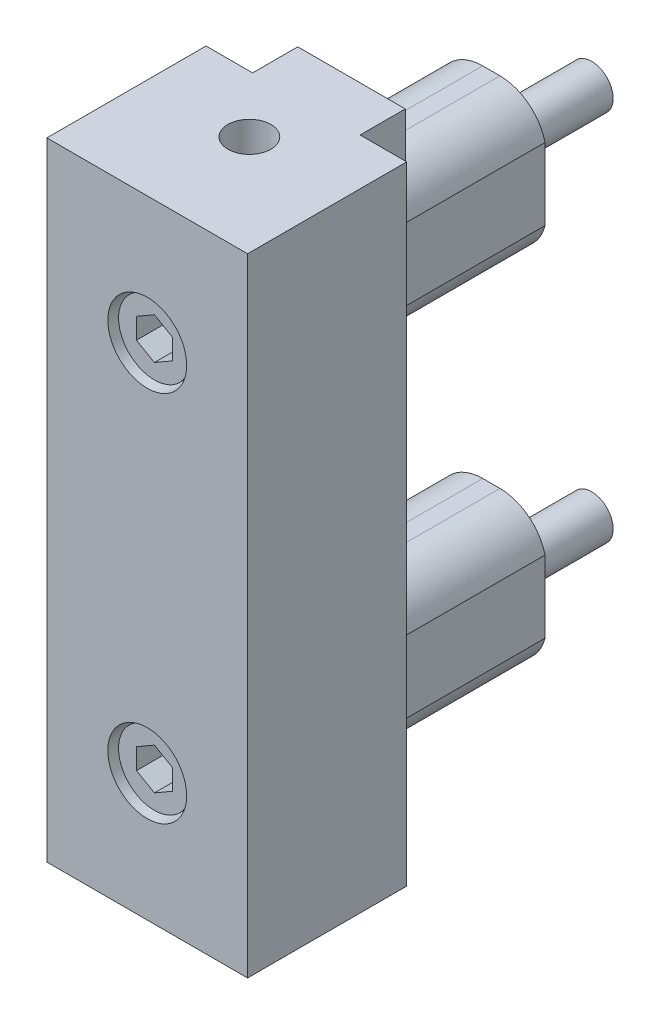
ISO-10303-21;
HEADER;
FILE_DESCRIPTION(('STEP AP214'),'2;1');
FILE_NAME('part.step','',(''),(''),'','','');
FILE_SCHEMA(('AUTOMOTIVE_DESIGN { 1 0 10303 214 1 1 1 1 }'));
ENDSEC;
DATA;
#1=APPLICATION_CONTEXT('core data for automotive mechanical design processes');
#2=APPLICATION_PROTOCOL_DEFINITION('international standard','automotive_design',2000,#1);
#3=PRODUCT_CONTEXT('',#1,'mechanical');
#4=PRODUCT('Part','Part','',(#3));
#5=PRODUCT_RELATED_PRODUCT_CATEGORY('part','',(#4));
#6=PRODUCT_DEFINITION_FORMATION('','',#4);
#7=PRODUCT_DEFINITION_CONTEXT('part definition',#1,'design');
#8=PRODUCT_DEFINITION('design','',#6,#7);
#9=PRODUCT_DEFINITION_SHAPE('','',#8);
#10=(LENGTH_UNIT() NAMED_UNIT(*) SI_UNIT(.MILLI.,.METRE.));
#11=(NAMED_UNIT(*) PLANE_ANGLE_UNIT() SI_UNIT($,.RADIAN.));
#12=(NAMED_UNIT(*) SI_UNIT($,.STERADIAN.) SOLID_ANGLE_UNIT());
#13=UNCERTAINTY_MEASURE_WITH_UNIT(LENGTH_MEASURE(1.E-05),#10,'distance_accuracy_value','');
#14=(GEOMETRIC_REPRESENTATION_CONTEXT(3) GLOBAL_UNCERTAINTY_ASSIGNED_CONTEXT((#13)) GLOBAL_UNIT_ASSIGNED_CONTEXT((#10,
#11,#12)) REPRESENTATION_CONTEXT('',''));
#15=CARTESIAN_POINT('',(0.,0.,0.));
#16=DIRECTION('',(0.,0.,1.));
#17=DIRECTION('',(1.,0.,0.));
#18=AXIS2_PLACEMENT_3D('',#15,#16,#17);
#19=CARTESIAN_POINT('',(-2.4999999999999,-27.4433756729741,23.24));
#20=DIRECTION('',(0.,0.,1.));
#21=DIRECTION('',(0.5,-0.866025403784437,0.));
#22=AXIS2_PLACEMENT_3D('',#19,#20,#21);
#23=PLANE('',#22);
#24=DIRECTION('',(0.866025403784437,0.5,0.));
#25=VECTOR('',#24,1.);
#26=CARTESIAN_POINT('',(-2.50000000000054,-24.5566243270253,23.24));
#27=LINE('',#26,#25);
#28=CARTESIAN_POINT('',(-2.50000000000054,-24.5566243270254,23.24));
#29=VERTEX_POINT('',#28);
#30=CARTESIAN_POINT('',(-2.94868156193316E-13,-23.1132486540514,23.24));
#31=VERTEX_POINT('',#30);
#32=EDGE_CURVE('E1874',#29,#31,#27,.T.);
#33=ORIENTED_EDGE('',*,*,#32,.F.);
#34=DIRECTION('',(0.,-1.,0.));
#35=VECTOR('',#34,1.);
#36=CARTESIAN_POINT('',(-2.50000000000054,-24.5566243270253,23.24));
#37=LINE('',#36,#35);
#38=CARTESIAN_POINT('',(-2.50000000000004,-27.443375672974,23.24));
#39=VERTEX_POINT('',#38);
#40=EDGE_CURVE('E1859',#29,#39,#37,.T.);
#41=ORIENTED_EDGE('',*,*,#40,.T.);
#42=DIRECTION('',(-0.866025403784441,0.5,0.));
#43=VECTOR('',#42,1.);
#44=CARTESIAN_POINT('',(0.,-28.8867513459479,23.24));
#45=LINE('',#44,#43);
#46=CARTESIAN_POINT('',(0.,-28.8867513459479,23.24));
#47=VERTEX_POINT('',#46);
#48=EDGE_CURVE('E1849',#47,#39,#45,.T.);
#49=ORIENTED_EDGE('',*,*,#48,.F.);
#50=DIRECTION('',(0.866025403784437,0.5,0.));
#51=VECTOR('',#50,1.);
#52=CARTESIAN_POINT('',(0.,-28.8867513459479,23.24));
#53=LINE('',#52,#51);
#54=CARTESIAN_POINT('',(2.5,-27.4433756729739,23.24));
#55=VERTEX_POINT('',#54);
#56=EDGE_CURVE('E375',#47,#55,#53,.T.);
#57=ORIENTED_EDGE('',*,*,#56,.T.);
#58=DIRECTION('',(0.,1.,0.));
#59=VECTOR('',#58,1.);
#60=CARTESIAN_POINT('',(2.50000000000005,-27.4433756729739,23.24));
#61=LINE('',#60,#59);
#62=CARTESIAN_POINT('',(2.49999999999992,-24.5566243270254,23.24));
#63=VERTEX_POINT('',#62);
#64=EDGE_CURVE('E1695',#55,#63,#61,.T.);
#65=ORIENTED_EDGE('',*,*,#64,.T.);
#66=DIRECTION('',(0.866025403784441,-0.5,0.));
#67=VECTOR('',#66,1.);
#68=CARTESIAN_POINT('',(-2.41308568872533E-13,-23.1132486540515,23.24));
#69=LINE('',#68,#67);
#70=EDGE_CURVE('E1704',#31,#63,#69,.T.);
#71=ORIENTED_EDGE('',*,*,#70,.F.);
#72=EDGE_LOOP('',(#33,#41,#49,#57,#65,#71));
#73=FACE_BOUND('',#72,.T.);
#74=ADVANCED_FACE('F16',(#73),#23,.T.);
#75=CARTESIAN_POINT('',(0.,-28.8867513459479,23.24));
#76=DIRECTION('',(0.5,0.866025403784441,0.));
#77=DIRECTION('',(-0.866025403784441,0.5,0.));
#78=AXIS2_PLACEMENT_3D('',#75,#76,#77);
#79=PLANE('',#78);
#80=ORIENTED_EDGE('',*,*,#48,.T.);
#81=DIRECTION('',(0.,0.,1.));
#82=VECTOR('',#81,1.);
#83=CARTESIAN_POINT('',(-2.49999999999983,-27.4433756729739,23.24));
#84=LINE('',#83,#82);
#85=CARTESIAN_POINT('',(-2.50000000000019,-27.443375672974,27.5));
#86=VERTEX_POINT('',#85);
#87=EDGE_CURVE('E1845',#39,#86,#84,.T.);
#88=ORIENTED_EDGE('',*,*,#87,.T.);
#89=DIRECTION('',(0.866025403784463,-0.499999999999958,0.));
#90=VECTOR('',#89,1.);
#91=CARTESIAN_POINT('',(-2.4999999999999,-27.4433756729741,27.5));
#92=LINE('',#91,#90);
#93=CARTESIAN_POINT('',(0.,-28.8867513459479,27.5));
#94=VERTEX_POINT('',#93);
#95=EDGE_CURVE('E1718',#86,#94,#92,.T.);
#96=ORIENTED_EDGE('',*,*,#95,.T.);
#97=DIRECTION('',(0.,0.,1.));
#98=VECTOR('',#97,1.);
#99=CARTESIAN_POINT('',(0.,-28.8867513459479,23.24));
#100=LINE('',#99,#98);
#101=EDGE_CURVE('E1854',#94,#47,#100,.F.);
#102=ORIENTED_EDGE('',*,*,#101,.T.);
#103=EDGE_LOOP('',(#80,#88,#96,#102));
#104=FACE_BOUND('',#103,.T.);
#105=ADVANCED_FACE('F866',(#104),#79,.T.);
#106=CARTESIAN_POINT('',(0.,-28.8867513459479,23.24));
#107=DIRECTION('',(0.5,-0.866025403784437,0.));
#108=DIRECTION('',(0.866025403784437,0.5,0.));
#109=AXIS2_PLACEMENT_3D('',#106,#107,#108);
#110=PLANE('',#109);
#111=DIRECTION('',(0.,0.,1.));
#112=VECTOR('',#111,1.);
#113=CARTESIAN_POINT('',(2.50000000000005,-27.4433756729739,23.24));
#114=LINE('',#113,#112);
#115=CARTESIAN_POINT('',(2.5,-27.4433756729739,27.5));
#116=VERTEX_POINT('',#115);
#117=EDGE_CURVE('E1685',#116,#55,#114,.F.);
#118=ORIENTED_EDGE('',*,*,#117,.T.);
#119=ORIENTED_EDGE('',*,*,#56,.F.);
#120=ORIENTED_EDGE('',*,*,#101,.F.);
#121=DIRECTION('',(0.866025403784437,0.5,0.));
#122=VECTOR('',#121,1.);
#123=CARTESIAN_POINT('',(1.25,-28.1650635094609,27.5));
#124=LINE('',#123,#122);
#125=EDGE_CURVE('E1691',#94,#116,#124,.T.);
#126=ORIENTED_EDGE('',*,*,#125,.T.);
#127=EDGE_LOOP('',(#118,#119,#120,#126));
#128=FACE_BOUND('',#127,.T.);
#129=ADVANCED_FACE('F872',(#128),#110,.F.);
#130=CARTESIAN_POINT('',(2.50000000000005,-27.4433756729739,23.24));
#131=DIRECTION('',(1.,0.,0.));
#132=DIRECTION('',(0.,1.,0.));
#133=AXIS2_PLACEMENT_3D('',#130,#131,#132);
#134=PLANE('',#133);
#135=DIRECTION('',(0.,0.,1.));
#136=VECTOR('',#135,1.);
#137=CARTESIAN_POINT('',(2.49999999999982,-24.5566243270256,23.24));
#138=LINE('',#137,#136);
#139=CARTESIAN_POINT('',(2.49999999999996,-24.5566243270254,27.5));
#140=VERTEX_POINT('',#139);
#141=EDGE_CURVE('E1700',#63,#140,#138,.T.);
#142=ORIENTED_EDGE('',*,*,#141,.F.);
#143=ORIENTED_EDGE('',*,*,#64,.F.);
#144=ORIENTED_EDGE('',*,*,#117,.F.);
#145=DIRECTION('',(0.,1.,0.));
#146=VECTOR('',#145,1.);
#147=CARTESIAN_POINT('',(2.50000000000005,-27.4433756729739,27.5));
#148=LINE('',#147,#146);
#149=EDGE_CURVE('E1838',#116,#140,#148,.T.);
#150=ORIENTED_EDGE('',*,*,#149,.T.);
#151=EDGE_LOOP('',(#142,#143,#144,#150));
#152=FACE_BOUND('',#151,.T.);
#153=ADVANCED_FACE('F1650',(#152),#134,.F.);
#154=CARTESIAN_POINT('',(-2.41308568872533E-13,-23.1132486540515,23.24));
#155=DIRECTION('',(-0.5,-0.866025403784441,0.));
#156=DIRECTION('',(0.866025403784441,-0.5,0.));
#157=AXIS2_PLACEMENT_3D('',#154,#155,#156);
#158=PLANE('',#157);
#159=ORIENTED_EDGE('',*,*,#70,.T.);
#160=ORIENTED_EDGE('',*,*,#141,.T.);
#161=DIRECTION('',(-0.866025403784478,0.499999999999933,0.));
#162=VECTOR('',#161,1.);
#163=CARTESIAN_POINT('',(2.49999999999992,-24.5566243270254,27.5));
#164=LINE('',#163,#162);
#165=CARTESIAN_POINT('',(-2.94868156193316E-13,-23.1132486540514,27.5));
#166=VERTEX_POINT('',#165);
#167=EDGE_CURVE('E1834',#140,#166,#164,.T.);
#168=ORIENTED_EDGE('',*,*,#167,.T.);
#169=DIRECTION('',(0.,0.,1.));
#170=VECTOR('',#169,1.);
#171=CARTESIAN_POINT('',(-4.5554691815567E-13,-23.1132486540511,23.24));
#172=LINE('',#171,#170);
#173=EDGE_CURVE('E1869',#31,#166,#172,.T.);
#174=ORIENTED_EDGE('',*,*,#173,.F.);
#175=EDGE_LOOP('',(#159,#160,#168,#174));
#176=FACE_BOUND('',#175,.T.);
#177=ADVANCED_FACE('F1641',(#176),#158,.T.);
#178=CARTESIAN_POINT('',(-2.50000000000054,-24.5566243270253,23.24));
#179=DIRECTION('',(0.5,-0.866025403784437,0.));
#180=DIRECTION('',(0.866025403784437,0.5,0.));
#181=AXIS2_PLACEMENT_3D('',#178,#179,#180);
#182=PLANE('',#181);
#183=ORIENTED_EDGE('',*,*,#32,.T.);
#184=ORIENTED_EDGE('',*,*,#173,.T.);
#185=DIRECTION('',(0.866025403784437,0.5,0.));
#186=VECTOR('',#185,1.);
#187=CARTESIAN_POINT('',(-1.25000000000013,-23.8349364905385,27.5));
#188=LINE('',#187,#186);
#189=CARTESIAN_POINT('',(-2.50000000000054,-24.5566243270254,27.5));
#190=VERTEX_POINT('',#189);
#191=EDGE_CURVE('E1830',#166,#190,#188,.F.);
#192=ORIENTED_EDGE('',*,*,#191,.T.);
#193=DIRECTION('',(0.,0.,1.));
#194=VECTOR('',#193,1.);
#195=CARTESIAN_POINT('',(-2.50000000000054,-24.5566243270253,23.24));
#196=LINE('',#195,#194);
#197=EDGE_CURVE('E1864',#190,#29,#196,.F.);
#198=ORIENTED_EDGE('',*,*,#197,.T.);
#199=EDGE_LOOP('',(#183,#184,#192,#198));
#200=FACE_BOUND('',#199,.T.);
#201=ADVANCED_FACE('F1634',(#200),#182,.T.);
#202=CARTESIAN_POINT('',(-2.50000000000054,-24.5566243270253,23.24));
#203=DIRECTION('',(-1.,0.,0.));
#204=DIRECTION('',(0.,-1.,0.));
#205=AXIS2_PLACEMENT_3D('',#202,#203,#204);
#206=PLANE('',#205);
#207=ORIENTED_EDGE('',*,*,#87,.F.);
#208=ORIENTED_EDGE('',*,*,#40,.F.);
#209=ORIENTED_EDGE('',*,*,#197,.F.);
#210=DIRECTION('',(2.22094394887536E-13,-1.,0.));
#211=VECTOR('',#210,1.);
#212=CARTESIAN_POINT('',(-2.50000000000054,-24.5566243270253,27.5));
#213=LINE('',#212,#211);
#214=EDGE_CURVE('E36',#190,#86,#213,.T.);
#215=ORIENTED_EDGE('',*,*,#214,.T.);
#216=EDGE_LOOP('',(#207,#208,#209,#215));
#217=FACE_BOUND('',#216,.T.);
#218=ADVANCED_FACE('F883',(#217),#206,.F.);
#219=CARTESIAN_POINT('',(-2.3750000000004,-21.8863793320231,27.5));
#220=DIRECTION('',(0.,0.,-1.));
#221=DIRECTION('',(-0.5,0.866025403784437,0.));
#222=AXIS2_PLACEMENT_3D('',#219,#220,#221);
#223=PLANE('',#222);
#224=CARTESIAN_POINT('',(0.,-26.,27.5));
#225=DIRECTION('',(0.,0.,-1.));
#226=DIRECTION('',(-0.5,0.866025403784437,0.));
#227=AXIS2_PLACEMENT_3D('',#224,#225,#226);
#228=CIRCLE('',#227,5.00000000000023);
#229=CARTESIAN_POINT('',(-2.50000000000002,-21.6698729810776,27.5));
#230=VERTEX_POINT('',#229);
#231=EDGE_CURVE('E1717',#230,#230,#228,.T.);
#232=ORIENTED_EDGE('',*,*,#231,.F.);
#233=EDGE_LOOP('',(#232));
#234=FACE_BOUND('',#233,.T.);
#235=ORIENTED_EDGE('',*,*,#214,.F.);
#236=ORIENTED_EDGE('',*,*,#191,.F.);
#237=ORIENTED_EDGE('',*,*,#167,.F.);
#238=ORIENTED_EDGE('',*,*,#149,.F.);
#239=ORIENTED_EDGE('',*,*,#125,.F.);
#240=ORIENTED_EDGE('',*,*,#95,.F.);
#241=EDGE_LOOP('',(#235,#236,#237,#238,#239,#240));
#242=FACE_BOUND('',#241,.T.);
#243=ADVANCED_FACE('F879',(#234,#242),#223,.F.);
#244=CARTESIAN_POINT('',(0.,-26.,21.5));
#245=DIRECTION('',(0.,0.,1.));
#246=DIRECTION('',(0.5,-0.866025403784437,0.));
#247=AXIS2_PLACEMENT_3D('',#244,#245,#246);
#248=CYLINDRICAL_SURFACE('',#247,5.00000000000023);
#249=CARTESIAN_POINT('',(0.,-26.,21.5));
#250=DIRECTION('',(0.,0.,1.));
#251=DIRECTION('',(0.5,-0.866025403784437,0.));
#252=AXIS2_PLACEMENT_3D('',#249,#250,#251);
#253=CIRCLE('',#252,5.00000000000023);
#254=CARTESIAN_POINT('',(2.50000000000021,-30.3301270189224,21.5));
#255=VERTEX_POINT('',#254);
#256=EDGE_CURVE('E1713',#255,#255,#253,.T.);
#257=ORIENTED_EDGE('',*,*,#256,.T.);
#258=EDGE_LOOP('',(#257));
#259=FACE_BOUND('',#258,.T.);
#260=ORIENTED_EDGE('',*,*,#231,.T.);
#261=EDGE_LOOP('',(#260));
#262=FACE_BOUND('',#261,.T.);
#263=ADVANCED_FACE('F882',(#259,#262),#248,.T.);
#264=CARTESIAN_POINT('',(-2.50000000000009,24.556624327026,23.24));
#265=DIRECTION('',(0.,0.,1.));
#266=DIRECTION('',(0.5,-0.866025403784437,0.));
#267=AXIS2_PLACEMENT_3D('',#264,#265,#266);
#268=PLANE('',#267);
#269=DIRECTION('',(0.866025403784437,0.5,0.));
#270=VECTOR('',#269,1.);
#271=CARTESIAN_POINT('',(-2.50000000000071,27.4433756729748,23.24));
#272=LINE('',#271,#270);
#273=CARTESIAN_POINT('',(-2.50000000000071,27.4433756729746,23.24));
#274=VERTEX_POINT('',#273);
#275=CARTESIAN_POINT('',(-4.7642518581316E-13,28.8867513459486,23.24));
#276=VERTEX_POINT('',#275);
#277=EDGE_CURVE('E1766',#274,#276,#272,.T.);
#278=ORIENTED_EDGE('',*,*,#277,.F.);
#279=DIRECTION('',(0.,-1.,0.));
#280=VECTOR('',#279,1.);
#281=CARTESIAN_POINT('',(-2.50000000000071,27.4433756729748,23.24));
#282=LINE('',#281,#280);
#283=CARTESIAN_POINT('',(-2.50000000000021,24.556624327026,23.24));
#284=VERTEX_POINT('',#283);
#285=EDGE_CURVE('E1755',#274,#284,#282,.T.);
#286=ORIENTED_EDGE('',*,*,#285,.T.);
#287=DIRECTION('',(-0.866025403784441,0.5,0.));
#288=VECTOR('',#287,1.);
#289=CARTESIAN_POINT('',(-1.84782884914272E-13,23.1132486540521,23.24));
#290=LINE('',#289,#288);
#291=CARTESIAN_POINT('',(-1.84782884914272E-13,23.1132486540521,23.24));
#292=VERTEX_POINT('',#291);
#293=EDGE_CURVE('E1747',#292,#284,#290,.T.);
#294=ORIENTED_EDGE('',*,*,#293,.F.);
#295=DIRECTION('',(0.866025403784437,0.5,0.));
#296=VECTOR('',#295,1.);
#297=CARTESIAN_POINT('',(-1.84782884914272E-13,23.1132486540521,23.24));
#298=LINE('',#297,#296);
#299=CARTESIAN_POINT('',(2.49999999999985,24.5566243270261,23.24));
#300=VERTEX_POINT('',#299);
#301=EDGE_CURVE('E342',#292,#300,#298,.T.);
#302=ORIENTED_EDGE('',*,*,#301,.T.);
#303=DIRECTION('',(0.,1.,0.));
#304=VECTOR('',#303,1.);
#305=CARTESIAN_POINT('',(2.49999999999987,24.5566243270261,23.24));
#306=LINE('',#305,#304);
#307=CARTESIAN_POINT('',(2.49999999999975,27.4433756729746,23.24));
#308=VERTEX_POINT('',#307);
#309=EDGE_CURVE('E354',#300,#308,#306,.T.);
#310=ORIENTED_EDGE('',*,*,#309,.T.);
#311=DIRECTION('',(0.866025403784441,-0.5,0.));
#312=VECTOR('',#311,1.);
#313=CARTESIAN_POINT('',(-4.22865598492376E-13,28.8867513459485,23.24));
#314=LINE('',#313,#312);
#315=EDGE_CURVE('E1774',#276,#308,#314,.T.);
#316=ORIENTED_EDGE('',*,*,#315,.F.);
#317=EDGE_LOOP('',(#278,#286,#294,#302,#310,#316));
#318=FACE_BOUND('',#317,.T.);
#319=ADVANCED_FACE('F887',(#318),#268,.T.);
#320=CARTESIAN_POINT('',(-1.84782884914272E-13,23.1132486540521,23.24));
#321=DIRECTION('',(0.5,0.866025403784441,0.));
#322=DIRECTION('',(-0.866025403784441,0.5,0.));
#323=AXIS2_PLACEMENT_3D('',#320,#321,#322);
#324=PLANE('',#323);
#325=ORIENTED_EDGE('',*,*,#293,.T.);
#326=DIRECTION('',(0.,0.,1.));
#327=VECTOR('',#326,1.);
#328=CARTESIAN_POINT('',(-2.5,24.5566243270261,23.24));
#329=LINE('',#328,#327);
#330=CARTESIAN_POINT('',(-2.50000000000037,24.556624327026,27.5));
#331=VERTEX_POINT('',#330);
#332=EDGE_CURVE('E1743',#284,#331,#329,.T.);
#333=ORIENTED_EDGE('',*,*,#332,.T.);
#334=DIRECTION('',(0.866025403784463,-0.499999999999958,0.));
#335=VECTOR('',#334,1.);
#336=CARTESIAN_POINT('',(-2.50000000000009,24.556624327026,27.5));
#337=LINE('',#336,#335);
#338=CARTESIAN_POINT('',(-1.84782884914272E-13,23.1132486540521,27.5));
#339=VERTEX_POINT('',#338);
#340=EDGE_CURVE('E363',#331,#339,#337,.T.);
#341=ORIENTED_EDGE('',*,*,#340,.T.);
#342=DIRECTION('',(0.,0.,1.));
#343=VECTOR('',#342,1.);
#344=CARTESIAN_POINT('',(-1.84782884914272E-13,23.1132486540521,23.24));
#345=LINE('',#344,#343);
#346=EDGE_CURVE('E1751',#339,#292,#345,.F.);
#347=ORIENTED_EDGE('',*,*,#346,.T.);
#348=EDGE_LOOP('',(#325,#333,#341,#347));
#349=FACE_BOUND('',#348,.T.);
#350=ADVANCED_FACE('F898',(#349),#324,.T.);
#351=CARTESIAN_POINT('',(-1.84782884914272E-13,23.1132486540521,23.24));
#352=DIRECTION('',(0.5,-0.866025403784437,0.));
#353=DIRECTION('',(0.866025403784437,0.5,0.));
#354=AXIS2_PLACEMENT_3D('',#351,#352,#353);
#355=PLANE('',#354);
#356=DIRECTION('',(0.,0.,1.));
#357=VECTOR('',#356,1.);
#358=CARTESIAN_POINT('',(2.49999999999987,24.5566243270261,23.24));
#359=LINE('',#358,#357);
#360=CARTESIAN_POINT('',(2.49999999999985,24.5566243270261,27.5));
#361=VERTEX_POINT('',#360);
#362=EDGE_CURVE('E347',#361,#300,#359,.F.);
#363=ORIENTED_EDGE('',*,*,#362,.T.);
#364=ORIENTED_EDGE('',*,*,#301,.F.);
#365=ORIENTED_EDGE('',*,*,#346,.F.);
#366=DIRECTION('',(0.866025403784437,0.5,0.));
#367=VECTOR('',#366,1.);
#368=CARTESIAN_POINT('',(1.24999999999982,23.8349364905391,27.5));
#369=LINE('',#368,#367);
#370=EDGE_CURVE('E1740',#339,#361,#369,.T.);
#371=ORIENTED_EDGE('',*,*,#370,.T.);
#372=EDGE_LOOP('',(#363,#364,#365,#371));
#373=FACE_BOUND('',#372,.T.);
#374=ADVANCED_FACE('F901',(#373),#355,.F.);
#375=CARTESIAN_POINT('',(2.49999999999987,24.5566243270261,23.24));
#376=DIRECTION('',(1.,0.,0.));
#377=DIRECTION('',(0.,1.,0.));
#378=AXIS2_PLACEMENT_3D('',#375,#376,#377);
#379=PLANE('',#378);
#380=DIRECTION('',(0.,0.,1.));
#381=VECTOR('',#380,1.);
#382=CARTESIAN_POINT('',(2.49999999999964,27.4433756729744,23.24));
#383=LINE('',#382,#381);
#384=CARTESIAN_POINT('',(2.49999999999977,27.4433756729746,27.5));
#385=VERTEX_POINT('',#384);
#386=EDGE_CURVE('E1770',#308,#385,#383,.T.);
#387=ORIENTED_EDGE('',*,*,#386,.F.);
#388=ORIENTED_EDGE('',*,*,#309,.F.);
#389=ORIENTED_EDGE('',*,*,#362,.F.);
#390=DIRECTION('',(0.,1.,0.));
#391=VECTOR('',#390,1.);
#392=CARTESIAN_POINT('',(2.49999999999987,24.5566243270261,27.5));
#393=LINE('',#392,#391);
#394=EDGE_CURVE('E1737',#361,#385,#393,.T.);
#395=ORIENTED_EDGE('',*,*,#394,.T.);
#396=EDGE_LOOP('',(#387,#388,#389,#395));
#397=FACE_BOUND('',#396,.T.);
#398=ADVANCED_FACE('F915',(#397),#379,.F.);
#399=CARTESIAN_POINT('',(-4.22865598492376E-13,28.8867513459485,23.24));
#400=DIRECTION('',(-0.5,-0.866025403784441,0.));
#401=DIRECTION('',(0.866025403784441,-0.5,0.));
#402=AXIS2_PLACEMENT_3D('',#399,#400,#401);
#403=PLANE('',#402);
#404=ORIENTED_EDGE('',*,*,#315,.T.);
#405=ORIENTED_EDGE('',*,*,#386,.T.);
#406=DIRECTION('',(-0.866025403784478,0.499999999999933,0.));
#407=VECTOR('',#406,1.);
#408=CARTESIAN_POINT('',(2.49999999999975,27.4433756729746,27.5));
#409=LINE('',#408,#407);
#410=CARTESIAN_POINT('',(-4.7642518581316E-13,28.8867513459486,27.5));
#411=VERTEX_POINT('',#410);
#412=EDGE_CURVE('E1734',#385,#411,#409,.T.);
#413=ORIENTED_EDGE('',*,*,#412,.T.);
#414=DIRECTION('',(0.,0.,1.));
#415=VECTOR('',#414,1.);
#416=CARTESIAN_POINT('',(-6.37103947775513E-13,28.8867513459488,23.24));
#417=LINE('',#416,#415);
#418=EDGE_CURVE('E1762',#276,#411,#417,.T.);
#419=ORIENTED_EDGE('',*,*,#418,.F.);
#420=EDGE_LOOP('',(#404,#405,#413,#419));
#421=FACE_BOUND('',#420,.T.);
#422=ADVANCED_FACE('F911',(#421),#403,.T.);
#423=CARTESIAN_POINT('',(-2.50000000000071,27.4433756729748,23.24));
#424=DIRECTION('',(0.5,-0.866025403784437,0.));
#425=DIRECTION('',(0.866025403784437,0.5,0.));
#426=AXIS2_PLACEMENT_3D('',#423,#424,#425);
#427=PLANE('',#426);
#428=ORIENTED_EDGE('',*,*,#277,.T.);
#429=ORIENTED_EDGE('',*,*,#418,.T.);
#430=DIRECTION('',(0.866025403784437,0.5,0.));
#431=VECTOR('',#430,1.);
#432=CARTESIAN_POINT('',(-1.25000000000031,28.1650635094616,27.5));
#433=LINE('',#432,#431);
#434=CARTESIAN_POINT('',(-2.50000000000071,27.4433756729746,27.5));
#435=VERTEX_POINT('',#434);
#436=EDGE_CURVE('E1731',#411,#435,#433,.F.);
#437=ORIENTED_EDGE('',*,*,#436,.T.);
#438=DIRECTION('',(0.,0.,1.));
#439=VECTOR('',#438,1.);
#440=CARTESIAN_POINT('',(-2.50000000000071,27.4433756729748,23.24));
#441=LINE('',#440,#439);
#442=EDGE_CURVE('E1758',#435,#274,#441,.F.);
#443=ORIENTED_EDGE('',*,*,#442,.T.);
#444=EDGE_LOOP('',(#428,#429,#437,#443));
#445=FACE_BOUND('',#444,.T.);
#446=ADVANCED_FACE('F907',(#445),#427,.T.);
#447=CARTESIAN_POINT('',(-2.50000000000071,27.4433756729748,23.24));
#448=DIRECTION('',(-1.,0.,0.));
#449=DIRECTION('',(0.,-1.,0.));
#450=AXIS2_PLACEMENT_3D('',#447,#448,#449);
#451=PLANE('',#450);
#452=ORIENTED_EDGE('',*,*,#332,.F.);
#453=ORIENTED_EDGE('',*,*,#285,.F.);
#454=ORIENTED_EDGE('',*,*,#442,.F.);
#455=DIRECTION('',(2.22038883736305E-13,-1.,0.));
#456=VECTOR('',#455,1.);
#457=CARTESIAN_POINT('',(-2.50000000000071,27.4433756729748,27.5));
#458=LINE('',#457,#456);
#459=EDGE_CURVE('E1728',#435,#331,#458,.T.);
#460=ORIENTED_EDGE('',*,*,#459,.T.);
#461=EDGE_LOOP('',(#452,#453,#454,#460));
#462=FACE_BOUND('',#461,.T.);
#463=ADVANCED_FACE('F903',(#462),#451,.F.);
#464=CARTESIAN_POINT('',(-2.37500000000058,30.113620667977,27.5));
#465=DIRECTION('',(0.,0.,-1.));
#466=DIRECTION('',(-0.5,0.866025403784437,0.));
#467=AXIS2_PLACEMENT_3D('',#464,#465,#466);
#468=PLANE('',#467);
#469=CARTESIAN_POINT('',(0.,26.,27.5));
#470=DIRECTION('',(0.,0.,-1.));
#471=DIRECTION('',(-0.5,0.866025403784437,0.));
#472=AXIS2_PLACEMENT_3D('',#469,#470,#471);
#473=CIRCLE('',#472,5.00000000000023);
#474=CARTESIAN_POINT('',(-2.50000000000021,30.3301270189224,27.5));
#475=VERTEX_POINT('',#474);
#476=EDGE_CURVE('E362',#475,#475,#473,.T.);
#477=ORIENTED_EDGE('',*,*,#476,.F.);
#478=EDGE_LOOP('',(#477));
#479=FACE_BOUND('',#478,.T.);
#480=ORIENTED_EDGE('',*,*,#459,.F.);
#481=ORIENTED_EDGE('',*,*,#436,.F.);
#482=ORIENTED_EDGE('',*,*,#412,.F.);
#483=ORIENTED_EDGE('',*,*,#394,.F.);
#484=ORIENTED_EDGE('',*,*,#370,.F.);
#485=ORIENTED_EDGE('',*,*,#340,.F.);
#486=EDGE_LOOP('',(#480,#481,#482,#483,#484,#485));
#487=FACE_BOUND('',#486,.T.);
#488=ADVANCED_FACE('F906',(#479,#487),#468,.F.);
#489=CARTESIAN_POINT('',(0.,26.,21.5));
#490=DIRECTION('',(0.,0.,1.));
#491=DIRECTION('',(0.5,-0.866025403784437,0.));
#492=AXIS2_PLACEMENT_3D('',#489,#490,#491);
#493=CYLINDRICAL_SURFACE('',#492,5.00000000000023);
#494=CARTESIAN_POINT('',(0.,26.,21.5));
#495=DIRECTION('',(0.,0.,1.));
#496=DIRECTION('',(0.5,-0.866025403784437,0.));
#497=AXIS2_PLACEMENT_3D('',#494,#495,#496);
#498=CIRCLE('',#497,5.00000000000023);
#499=CARTESIAN_POINT('',(2.50000000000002,21.6698729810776,21.5));
#500=VERTEX_POINT('',#499);
#501=EDGE_CURVE('E358',#500,#500,#498,.T.);
#502=ORIENTED_EDGE('',*,*,#501,.T.);
#503=EDGE_LOOP('',(#502));
#504=FACE_BOUND('',#503,.T.);
#505=ORIENTED_EDGE('',*,*,#476,.T.);
#506=EDGE_LOOP('',(#505));
#507=FACE_BOUND('',#506,.T.);
#508=ADVANCED_FACE('F927',(#504,#507),#493,.T.);
#509=CARTESIAN_POINT('',(1.10854532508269E-13,-31.75,14.25));
#510=DIRECTION('',(0.,-1.,0.));
#511=DIRECTION('',(1.,0.,0.));
#512=AXIS2_PLACEMENT_3D('',#509,#510,#511);
#513=PLANE('',#512);
#514=CARTESIAN_POINT('',(1.10854532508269E-13,-31.75,14.25));
#515=DIRECTION('',(0.,-1.,0.));
#516=DIRECTION('',(1.,0.,0.));
#517=AXIS2_PLACEMENT_3D('',#514,#515,#516);
#518=CIRCLE('',#517,3.);
#519=CARTESIAN_POINT('',(3.00000000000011,-31.75,14.25));
#520=VERTEX_POINT('',#519);
#521=EDGE_CURVE('E385',#520,#520,#518,.T.);
#522=ORIENTED_EDGE('',*,*,#521,.T.);
#523=EDGE_LOOP('',(#522));
#524=FACE_BOUND('',#523,.T.);
#525=ADVANCED_FACE('F931',(#524),#513,.T.);
#526=CARTESIAN_POINT('',(-1.10854532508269E-13,31.75,14.25));
#527=DIRECTION('',(0.,1.,0.));
#528=DIRECTION('',(-1.,0.,0.));
#529=AXIS2_PLACEMENT_3D('',#526,#527,#528);
#530=PLANE('',#529);
#531=CARTESIAN_POINT('',(-1.10854532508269E-13,31.75,14.25));
#532=DIRECTION('',(0.,1.,0.));
#533=DIRECTION('',(-1.,0.,0.));
#534=AXIS2_PLACEMENT_3D('',#531,#532,#533);
#535=CIRCLE('',#534,3.);
#536=CARTESIAN_POINT('',(-3.00000000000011,31.75,14.25));
#537=VERTEX_POINT('',#536);
#538=EDGE_CURVE('E376',#537,#537,#535,.T.);
#539=ORIENTED_EDGE('',*,*,#538,.T.);
#540=EDGE_LOOP('',(#539));
#541=FACE_BOUND('',#540,.T.);
#542=ADVANCED_FACE('F936',(#541),#530,.T.);
#543=CARTESIAN_POINT('',(-1.04292942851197E-13,26.,-33.5));
#544=DIRECTION('',(0.,0.,1.));
#545=DIRECTION('',(0.5,-0.866025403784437,0.));
#546=AXIS2_PLACEMENT_3D('',#543,#544,#545);
#547=PLANE('',#546);
#548=CARTESIAN_POINT('',(0.,26.,-33.5));
#549=DIRECTION('',(0.,0.,1.));
#550=DIRECTION('',(0.5,-0.866025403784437,0.));
#551=AXIS2_PLACEMENT_3D('',#548,#549,#550);
#552=CIRCLE('',#551,3.00000000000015);
#553=CARTESIAN_POINT('',(1.49999999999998,23.4019237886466,-33.5));
#554=VERTEX_POINT('',#553);
#555=EDGE_CURVE('E367',#554,#554,#552,.T.);
#556=ORIENTED_EDGE('',*,*,#555,.F.);
#557=EDGE_LOOP('',(#556));
#558=FACE_BOUND('',#557,.T.);
#559=ADVANCED_FACE('F933',(#558),#547,.F.);
#560=CARTESIAN_POINT('',(-1.09981662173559E-13,31.5,21.5));
#561=DIRECTION('',(0.,0.,-1.));
#562=DIRECTION('',(-1.,0.,0.));
#563=AXIS2_PLACEMENT_3D('',#560,#561,#562);
#564=PLANE('',#563);
#565=ORIENTED_EDGE('',*,*,#501,.F.);
#566=EDGE_LOOP('',(#565));
#567=FACE_BOUND('',#566,.T.);
#568=CARTESIAN_POINT('',(0.,26.,21.5));
#569=DIRECTION('',(0.,0.,1.));
#570=DIRECTION('',(1.,0.,0.));
#571=AXIS2_PLACEMENT_3D('',#568,#569,#570);
#572=CIRCLE('',#571,5.5);
#573=CARTESIAN_POINT('',(5.49999999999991,26.,21.5));
#574=VERTEX_POINT('',#573);
#575=EDGE_CURVE('E539',#574,#574,#572,.T.);
#576=ORIENTED_EDGE('',*,*,#575,.T.);
#577=EDGE_LOOP('',(#576));
#578=FACE_BOUND('',#577,.T.);
#579=ADVANCED_FACE('F681',(#567,#578),#564,.F.);
#580=CARTESIAN_POINT('',(-9.14999999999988,-36.,6.3));
#581=DIRECTION('',(0.707106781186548,0.,0.707106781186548));
#582=DIRECTION('',(0.707106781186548,0.,-0.707106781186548));
#583=AXIS2_PLACEMENT_3D('',#580,#581,#582);
#584=PLANE('',#583);
#585=DIRECTION('',(0.,1.,0.));
#586=VECTOR('',#585,1.);
#587=CARTESIAN_POINT('',(-9.15000000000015,43.75,6.3));
#588=LINE('',#587,#586);
#589=CARTESIAN_POINT('',(-9.15000000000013,36.,6.3));
#590=VERTEX_POINT('',#589);
#591=CARTESIAN_POINT('',(-9.14999999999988,-36.,6.3));
#592=VERTEX_POINT('',#591);
#593=EDGE_CURVE('E405',#590,#592,#588,.F.);
#594=ORIENTED_EDGE('',*,*,#593,.T.);
#595=DIRECTION('',(0.707106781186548,0.,-0.707106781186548));
#596=VECTOR('',#595,1.);
#597=CARTESIAN_POINT('',(-10.6171572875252,-36.,7.76715728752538));
#598=LINE('',#597,#596);
#599=CARTESIAN_POINT('',(-10.8999999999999,-36.,8.05));
#600=VERTEX_POINT('',#599);
#601=EDGE_CURVE('E283',#592,#600,#598,.F.);
#602=ORIENTED_EDGE('',*,*,#601,.T.);
#603=DIRECTION('',(0.,1.,0.));
#604=VECTOR('',#603,1.);
#605=CARTESIAN_POINT('',(-10.8999999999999,-36.,8.05));
#606=LINE('',#605,#604);
#607=CARTESIAN_POINT('',(-10.9000000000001,36.,8.05));
#608=VERTEX_POINT('',#607);
#609=EDGE_CURVE('E305',#600,#608,#606,.T.);
#610=ORIENTED_EDGE('',*,*,#609,.T.);
#611=DIRECTION('',(0.707106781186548,0.,-0.707106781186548));
#612=VECTOR('',#611,1.);
#613=CARTESIAN_POINT('',(-10.6171572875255,36.,7.76715728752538));
#614=LINE('',#613,#612);
#615=EDGE_CURVE('E289',#608,#590,#614,.T.);
#616=ORIENTED_EDGE('',*,*,#615,.T.);
#617=EDGE_LOOP('',(#594,#602,#610,#616));
#618=FACE_BOUND('',#617,.T.);
#619=ADVANCED_FACE('F320',(#618),#584,.F.);
#620=CARTESIAN_POINT('',(-10.6171572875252,-36.,-1.1));
#621=DIRECTION('',(-1.,0.,0.));
#622=DIRECTION('',(0.,-1.,0.));
#623=AXIS2_PLACEMENT_3D('',#620,#621,#622);
#624=CONICAL_SURFACE('',#623,8.86715728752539,0.785398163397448);
#625=CARTESIAN_POINT('',(-9.14999999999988,-36.,6.3));
#626=CARTESIAN_POINT('',(-9.14998678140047,-36.113702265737,6.3));
#627=CARTESIAN_POINT('',(-9.1526202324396,-36.227400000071,6.3));
#628=CARTESIAN_POINT('',(-9.16308225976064,-36.45453867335,6.3));
#629=CARTESIAN_POINT('',(-9.17091000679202,-36.5679796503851,6.3));
#630=CARTESIAN_POINT('',(-9.19164256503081,-36.7941763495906,6.3));
#631=CARTESIAN_POINT('',(-9.20453760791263,-36.906932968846,6.3));
#632=CARTESIAN_POINT('',(-9.2352189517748,-37.1317739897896,6.3));
#633=CARTESIAN_POINT('',(-9.25300539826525,-37.2438583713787,6.3));
#634=CARTESIAN_POINT('',(-9.31272688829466,-37.5752791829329,6.3));
#635=CARTESIAN_POINT('',(-9.36137356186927,-37.7934324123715,6.3));
#636=CARTESIAN_POINT('',(-9.47461288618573,-38.225582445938,6.3));
#637=CARTESIAN_POINT('',(-9.53921274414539,-38.4395773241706,6.3));
#638=CARTESIAN_POINT('',(-9.67563848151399,-38.8440637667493,6.3));
#639=CARTESIAN_POINT('',(-9.74630672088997,-39.0349498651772,6.3));
#640=CARTESIAN_POINT('',(-9.89723477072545,-39.4128351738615,6.3));
#641=CARTESIAN_POINT('',(-9.97749325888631,-39.5998349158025,6.3));
#642=CARTESIAN_POINT('',(-10.1469641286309,-39.9719935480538,6.3));
#643=CARTESIAN_POINT('',(-10.2362587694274,-40.1571147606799,6.3));
#644=CARTESIAN_POINT('',(-10.4217824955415,-40.5238057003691,6.3));
#645=CARTESIAN_POINT('',(-10.5180108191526,-40.7053758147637,6.3));
#646=CARTESIAN_POINT('',(-10.7257258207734,-41.082391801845,6.3));
#647=CARTESIAN_POINT('',(-10.8377934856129,-41.2775165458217,6.3));
#648=CARTESIAN_POINT('',(-11.067743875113,-41.664320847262,6.3));
#649=CARTESIAN_POINT('',(-11.1856271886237,-41.8560000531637,6.3));
#650=CARTESIAN_POINT('',(-11.426290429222,-42.2363692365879,6.3));
#651=CARTESIAN_POINT('',(-11.5490724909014,-42.4250578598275,6.3));
#652=CARTESIAN_POINT('',(-11.7987175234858,-42.7997207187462,6.3));
#653=CARTESIAN_POINT('',(-11.925580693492,-42.9856948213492,6.3));
#654=CARTESIAN_POINT('',(-12.3120078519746,-43.5410261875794,6.3));
#655=CARTESIAN_POINT('',(-12.5767572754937,-43.9067766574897,6.3));
#656=CARTESIAN_POINT('',(-13.1162017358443,-44.6306787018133,6.3));
#657=CARTESIAN_POINT('',(-13.390894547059,-44.9888319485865,6.3));
#658=CARTESIAN_POINT('',(-13.9326206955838,-45.6798591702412,6.3));
#659=CARTESIAN_POINT('',(-14.1992551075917,-46.0130467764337,6.3));
#660=CARTESIAN_POINT('',(-14.7377778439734,-46.6751780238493,6.3));
#661=CARTESIAN_POINT('',(-15.0096665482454,-47.0041213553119,6.3));
#662=CARTESIAN_POINT('',(-15.5558338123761,-47.6564459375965,6.3));
#663=CARTESIAN_POINT('',(-15.8300860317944,-47.9798492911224,6.3));
#664=CARTESIAN_POINT('',(-16.3818818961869,-48.6237500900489,6.3));
#665=CARTESIAN_POINT('',(-16.6594250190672,-48.9442479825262,6.3));
#666=CARTESIAN_POINT('',(-16.938259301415,-49.2636051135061,6.3));
#667=B_SPLINE_CURVE_WITH_KNOTS('',3,(#625,#626,#627,#628,#629,#630,#631,#632,#633,#634,#635,
#636,#637,#638,#639,#640,#641,#642,#643,#644,#645,#646,#647,#648,#649,#650,#651,#652,#653,#654,
#655,#656,#657,#658,#659,#660,#661,#662,#663,#664,#665,#666),.UNSPECIFIED.,.F.,.F.,(4,2,2,2,2,2,
2,2,2,2,2,2,2,2,2,2,2,2,2,2,4),(0.,0.341068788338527,0.682083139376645,1.02244331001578,
1.36281360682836,2.03259232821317,2.70267419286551,3.31301759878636,3.92327694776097,
4.53970091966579,5.15605727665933,5.83098707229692,6.50598534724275,7.18128103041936,
7.85660970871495,9.21088612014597,10.564861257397,11.8450167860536,13.1252652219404,
14.3973399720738,15.6692155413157),.UNSPECIFIED.);
#668=CARTESIAN_POINT('',(-10.899999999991,-41.3816818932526,6.3));
#669=VERTEX_POINT('',#668);
#670=EDGE_CURVE('E408',#592,#669,#667,.T.);
#671=ORIENTED_EDGE('',*,*,#670,.T.);
#672=CARTESIAN_POINT('',(-10.8999999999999,-36.,-1.1));
#673=DIRECTION('',(-1.,0.,0.));
#674=DIRECTION('',(0.,-1.,0.));
#675=AXIS2_PLACEMENT_3D('',#672,#673,#674);
#676=CIRCLE('',#675,9.15);
#677=EDGE_CURVE('E322',#669,#600,#676,.T.);
#678=ORIENTED_EDGE('',*,*,#677,.T.);
#679=ORIENTED_EDGE('',*,*,#601,.F.);
#680=EDGE_LOOP('',(#671,#678,#679));
#681=FACE_BOUND('',#680,.T.);
#682=ADVANCED_FACE('F673',(#681),#624,.F.);
#683=CARTESIAN_POINT('',(-11.1828427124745,-36.,-1.1));
#684=DIRECTION('',(1.,0.,0.));
#685=DIRECTION('',(0.,0.,-1.));
#686=AXIS2_PLACEMENT_3D('',#683,#684,#685);
#687=CONICAL_SURFACE('',#686,8.86715728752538,0.785398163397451);
#688=DIRECTION('',(0.707106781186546,0.,0.70710678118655));
#689=VECTOR('',#688,1.);
#690=CARTESIAN_POINT('',(-11.1828427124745,-36.,7.76715728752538));
#691=LINE('',#690,#689);
#692=CARTESIAN_POINT('',(-12.6499999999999,-36.,6.3));
#693=VERTEX_POINT('',#692);
#694=EDGE_CURVE('E313',#693,#600,#691,.T.);
#695=ORIENTED_EDGE('',*,*,#694,.T.);
#696=ORIENTED_EDGE('',*,*,#677,.F.);
#697=CARTESIAN_POINT('',(23.8961429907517,-79.318627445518,6.3));
#698=CARTESIAN_POINT('',(22.8429104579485,-78.2501016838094,6.3));
#699=CARTESIAN_POINT('',(21.7902033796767,-77.1810571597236,6.3));
#700=CARTESIAN_POINT('',(19.6851073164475,-75.0404568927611,6.3));
#701=CARTESIAN_POINT('',(18.6327198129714,-73.96889969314,6.3));
#702=CARTESIAN_POINT('',(16.5120611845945,-71.8060084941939,6.3));
#703=CARTESIAN_POINT('',(15.4438203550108,-70.7146447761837,6.3));
#704=CARTESIAN_POINT('',(13.8438437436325,-69.0763713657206,6.3));
#705=CARTESIAN_POINT('',(13.3111901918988,-68.5303579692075,6.3));
#706=CARTESIAN_POINT('',(12.2466082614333,-67.4376535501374,6.3));
#707=CARTESIAN_POINT('',(11.7146798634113,-66.8909625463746,6.3));
#708=CARTESIAN_POINT('',(10.1904477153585,-65.3220651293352,6.3));
#709=CARTESIAN_POINT('',(9.19916934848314,-64.2988619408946,6.3));
#710=CARTESIAN_POINT('',(7.22038081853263,-62.2485445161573,6.3));
#711=CARTESIAN_POINT('',(6.23287118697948,-61.221429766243,6.3));
#712=CARTESIAN_POINT('',(4.75370402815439,-59.6745937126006,6.3));
#713=CARTESIAN_POINT('',(4.25996526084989,-59.1568627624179,6.3));
#714=CARTESIAN_POINT('',(3.27420064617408,-58.1197731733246,6.3));
#715=CARTESIAN_POINT('',(2.78217479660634,-57.6004145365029,6.3));
#716=CARTESIAN_POINT('',(1.80048004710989,-56.5599892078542,6.3));
#717=CARTESIAN_POINT('',(1.31081004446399,-56.0389235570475,6.3));
#718=CARTESIAN_POINT('',(0.334088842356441,-54.9943517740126,6.3));
#719=CARTESIAN_POINT('',(-0.152962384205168,-54.4708456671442,6.3));
#720=CARTESIAN_POINT('',(-1.11577624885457,-53.4293892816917,6.3));
#721=CARTESIAN_POINT('',(-1.5915929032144,-52.9114889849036,6.3));
#722=CARTESIAN_POINT('',(-2.53911227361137,-51.8718935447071,6.3));
#723=CARTESIAN_POINT('',(-3.01081481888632,-51.3501982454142,6.3));
#724=CARTESIAN_POINT('',(-3.94973266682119,-50.3008272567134,6.3));
#725=CARTESIAN_POINT('',(-4.41693662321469,-49.7731414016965,6.3));
#726=CARTESIAN_POINT('',(-5.34385830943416,-48.7113326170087,6.3));
#727=CARTESIAN_POINT('',(-5.80357705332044,-48.1772105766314,6.3));
#728=CARTESIAN_POINT('',(-6.48333917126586,-47.3716587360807,6.3));
#729=CARTESIAN_POINT('',(-6.70734798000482,-47.1035754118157,6.3));
#730=CARTESIAN_POINT('',(-7.15223340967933,-46.5648248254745,6.3));
#731=CARTESIAN_POINT('',(-7.37311007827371,-46.2941576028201,6.3));
#732=CARTESIAN_POINT('',(-7.81119705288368,-45.7495883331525,6.3));
#733=CARTESIAN_POINT('',(-8.02840498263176,-45.4756843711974,6.3));
#734=CARTESIAN_POINT('',(-8.45811872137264,-44.9242140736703,6.3));
#735=CARTESIAN_POINT('',(-8.6706246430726,-44.6466478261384,6.3));
#736=CARTESIAN_POINT('',(-9.08900771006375,-44.0881072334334,6.3));
#737=CARTESIAN_POINT('',(-9.29490593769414,-43.8071487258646,6.3));
#738=CARTESIAN_POINT('',(-9.69932374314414,-43.2398955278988,6.3));
#739=CARTESIAN_POINT('',(-9.89784245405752,-42.9536002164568,6.3));
#740=CARTESIAN_POINT('',(-10.2850977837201,-42.3749131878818,6.3));
#741=CARTESIAN_POINT('',(-10.4738452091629,-42.0825287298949,6.3));
#742=CARTESIAN_POINT('',(-10.8387940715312,-41.4900648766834,6.3));
#743=CARTESIAN_POINT('',(-11.0149997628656,-41.1899881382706,6.3));
#744=CARTESIAN_POINT('',(-11.219723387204,-40.8183901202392,6.3));
#745=CARTESIAN_POINT('',(-11.2562002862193,-40.7512261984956,6.3));
#746=CARTESIAN_POINT('',(-11.3282941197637,-40.6164275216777,6.3));
#747=CARTESIAN_POINT('',(-11.3639109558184,-40.54879271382,6.3));
#748=CARTESIAN_POINT('',(-11.4342310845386,-40.413031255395,6.3));
#749=CARTESIAN_POINT('',(-11.4689341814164,-40.3449045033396,6.3));
#750=CARTESIAN_POINT('',(-11.5373556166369,-40.2081609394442,6.3));
#751=CARTESIAN_POINT('',(-11.57107397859,-40.1395441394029,6.3));
#752=CARTESIAN_POINT('',(-11.6706611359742,-39.932923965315,6.3));
#753=CARTESIAN_POINT('',(-11.7349587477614,-39.7941570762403,6.3));
#754=CARTESIAN_POINT('',(-11.8587806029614,-39.5145117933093,6.3));
#755=CARTESIAN_POINT('',(-11.9183049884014,-39.3736334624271,6.3));
#756=CARTESIAN_POINT('',(-12.0306429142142,-39.0929338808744,6.3));
#757=CARTESIAN_POINT('',(-12.0835786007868,-38.9531618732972,6.3));
#758=CARTESIAN_POINT('',(-12.1836231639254,-38.6715603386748,6.3));
#759=CARTESIAN_POINT('',(-12.2307318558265,-38.5297307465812,6.3));
#760=CARTESIAN_POINT('',(-12.362226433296,-38.1013158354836,6.3));
#761=CARTESIAN_POINT('',(-12.4368738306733,-37.8115775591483,6.3));
#762=CARTESIAN_POINT('',(-12.5207335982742,-37.3945340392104,6.3));
#763=CARTESIAN_POINT('',(-12.5428776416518,-37.2697345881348,6.3));
#764=CARTESIAN_POINT('',(-12.5811609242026,-37.0192435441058,6.3));
#765=CARTESIAN_POINT('',(-12.5973021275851,-36.8935522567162,6.3));
#766=CARTESIAN_POINT('',(-12.6234477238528,-36.6400991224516,6.3));
#767=CARTESIAN_POINT('',(-12.6333808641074,-36.5123299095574,6.3));
#768=CARTESIAN_POINT('',(-12.6466694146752,-36.2563766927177,6.3));
#769=CARTESIAN_POINT('',(-12.6500210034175,-36.1281924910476,6.3));
#770=CARTESIAN_POINT('',(-12.6499999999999,-36.,6.3));
#771=B_SPLINE_CURVE_WITH_KNOTS('',3,(#697,#698,#699,#700,#701,#702,#703,#704,#705,#706,#707,
#708,#709,#710,#711,#712,#713,#714,#715,#716,#717,#718,#719,#720,#721,#722,#723,#724,#725,#726,
#727,#728,#729,#730,#731,#732,#733,#734,#735,#736,#737,#738,#739,#740,#741,#742,#743,#744,#745,
#746,#747,#748,#749,#750,#751,#752,#753,#754,#755,#756,#757,#758,#759,#760,#761,#762,#763,#764,
#765,#766,#767,#768,#769,#770),.UNSPECIFIED.,.F.,.F.,(4,2,2,2,2,2,2,2,2,2,2,2,2,2,2,2,2,2,2,2,2,
2,2,2,2,2,2,2,2,2,2,2,2,2,2,2,4),(0.,4.50104660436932,9.00679589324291,13.5882682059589,
15.8766412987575,18.1649522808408,22.4388427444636,26.7133152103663,28.8595670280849,
31.0058160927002,33.1509372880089,35.2960362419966,37.4059011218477,39.5158531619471,
41.6301847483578,43.7442274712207,44.7922728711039,45.8403023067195,46.8889863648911,
47.9376452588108,48.9825345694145,50.0275462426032,51.071376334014,52.1148506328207,
52.3441366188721,52.5734487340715,52.8028095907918,53.0321649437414,53.4908968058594,
53.9496150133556,54.3978650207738,54.8461292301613,55.7419244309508,56.1220606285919,
56.50207233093,56.886369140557,57.2708890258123),.UNSPECIFIED.);
#772=EDGE_CURVE('E404',#669,#693,#771,.T.);
#773=ORIENTED_EDGE('',*,*,#772,.T.);
#774=EDGE_LOOP('',(#695,#696,#773));
#775=FACE_BOUND('',#774,.T.);
#776=ADVANCED_FACE('F669',(#775),#687,.F.);
#777=CARTESIAN_POINT('',(-11.1828427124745,-36.,7.76715728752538));
#778=DIRECTION('',(-0.70710678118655,0.,0.707106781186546));
#779=DIRECTION('',(0.707106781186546,0.,0.70710678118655));
#780=AXIS2_PLACEMENT_3D('',#777,#778,#779);
#781=PLANE('',#780);
#782=DIRECTION('',(-0.707106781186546,0.,-0.707106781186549));
#783=VECTOR('',#782,1.);
#784=CARTESIAN_POINT('',(-12.6500000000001,36.,6.3));
#785=LINE('',#784,#783);
#786=CARTESIAN_POINT('',(-12.6500000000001,36.,6.3));
#787=VERTEX_POINT('',#786);
#788=EDGE_CURVE('E298',#787,#608,#785,.F.);
#789=ORIENTED_EDGE('',*,*,#788,.T.);
#790=ORIENTED_EDGE('',*,*,#609,.F.);
#791=ORIENTED_EDGE('',*,*,#694,.F.);
#792=DIRECTION('',(0.,1.,0.));
#793=VECTOR('',#792,1.);
#794=CARTESIAN_POINT('',(-12.6500000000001,43.75,6.3));
#795=LINE('',#794,#793);
#796=EDGE_CURVE('E308',#693,#787,#795,.T.);
#797=ORIENTED_EDGE('',*,*,#796,.T.);
#798=EDGE_LOOP('',(#789,#790,#791,#797));
#799=FACE_BOUND('',#798,.T.);
#800=ADVANCED_FACE('F303',(#799),#781,.F.);
#801=CARTESIAN_POINT('',(-11.1828427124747,36.,-1.1));
#802=DIRECTION('',(1.,0.,0.));
#803=DIRECTION('',(0.,1.,0.));
#804=AXIS2_PLACEMENT_3D('',#801,#802,#803);
#805=CONICAL_SURFACE('',#804,8.86715728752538,0.78539816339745);
#806=CARTESIAN_POINT('',(-12.6500000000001,36.,6.3));
#807=CARTESIAN_POINT('',(-12.6500131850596,36.1136307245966,6.3));
#808=CARTESIAN_POINT('',(-12.6473830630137,36.2272569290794,6.3));
#809=CARTESIAN_POINT('',(-12.6369341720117,36.4542530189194,6.3));
#810=CARTESIAN_POINT('',(-12.6291162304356,36.5676229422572,6.3));
#811=CARTESIAN_POINT('',(-12.6084093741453,36.7936798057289,6.3));
#812=CARTESIAN_POINT('',(-12.5955301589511,36.9063676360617,6.3));
#813=CARTESIAN_POINT('',(-12.5648861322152,37.1310722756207,6.3));
#814=CARTESIAN_POINT('',(-12.5471211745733,37.2430890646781,6.3));
#815=CARTESIAN_POINT('',(-12.4874215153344,37.5745864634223,6.3));
#816=CARTESIAN_POINT('',(-12.4387598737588,37.7928819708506,6.3));
#817=CARTESIAN_POINT('',(-12.3254689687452,38.2253112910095,6.3));
#818=CARTESIAN_POINT('',(-12.2608324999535,38.439443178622,6.3));
#819=CARTESIAN_POINT('',(-12.1241541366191,38.8446786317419,6.3));
#820=CARTESIAN_POINT('',(-12.0532424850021,39.0361673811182,6.3));
#821=CARTESIAN_POINT('',(-11.9017720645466,39.415232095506,6.3));
#822=CARTESIAN_POINT('',(-11.821214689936,39.6028086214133,6.3));
#823=CARTESIAN_POINT('',(-11.6516427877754,39.9749132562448,6.3));
#824=CARTESIAN_POINT('',(-11.5625981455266,40.1594275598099,6.3));
#825=CARTESIAN_POINT('',(-11.3776163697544,40.5249398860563,6.3));
#826=CARTESIAN_POINT('',(-11.2816795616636,40.7059380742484,6.3));
#827=CARTESIAN_POINT('',(-11.0777216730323,41.0761340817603,6.3));
#828=CARTESIAN_POINT('',(-10.9693200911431,41.2651215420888,6.3));
#829=CARTESIAN_POINT('',(-10.7470325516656,41.6398539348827,6.3));
#830=CARTESIAN_POINT('',(-10.6331460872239,41.8255985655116,6.3));
#831=CARTESIAN_POINT('',(-10.4007322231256,42.194259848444,6.3));
#832=CARTESIAN_POINT('',(-10.2822029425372,42.3771753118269,6.3));
#833=CARTESIAN_POINT('',(-10.0412554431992,42.7404311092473,6.3));
#834=CARTESIAN_POINT('',(-9.9188370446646,42.9207713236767,6.3));
#835=CARTESIAN_POINT('',(-9.54624380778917,43.4589693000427,6.3));
#836=CARTESIAN_POINT('',(-9.29111693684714,43.8134006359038,6.3));
#837=CARTESIAN_POINT('',(-8.77127103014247,44.5149901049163,6.3));
#838=CARTESIAN_POINT('',(-8.50655390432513,44.8621496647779,6.3));
#839=CARTESIAN_POINT('',(-7.96760398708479,45.553615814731,6.3));
#840=CARTESIAN_POINT('',(-7.69331059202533,45.8978750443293,6.3));
#841=CARTESIAN_POINT('',(-7.13900625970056,46.581768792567,6.3));
#842=CARTESIAN_POINT('',(-6.85899508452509,46.9214031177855,6.3));
#843=CARTESIAN_POINT('',(-6.29480008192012,47.5965442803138,6.3));
#844=CARTESIAN_POINT('',(-6.01062120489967,47.9320552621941,6.3));
#845=CARTESIAN_POINT('',(-5.43869223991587,48.6000021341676,6.3));
#846=CARTESIAN_POINT('',(-5.15094222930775,48.9324380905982,6.3));
#847=CARTESIAN_POINT('',(-4.56848534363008,49.5994142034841,6.3));
#848=CARTESIAN_POINT('',(-4.27373749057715,49.9339185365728,6.3));
#849=CARTESIAN_POINT('',(-3.68178732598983,50.6007495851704,6.3));
#850=CARTESIAN_POINT('',(-3.38458499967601,50.9330762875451,6.3));
#851=CARTESIAN_POINT('',(-2.48992646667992,51.9273410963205,6.3));
#852=CARTESIAN_POINT('',(-1.88943378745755,52.5865467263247,6.3));
#853=CARTESIAN_POINT('',(-0.682652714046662,53.8997446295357,6.3));
#854=CARTESIAN_POINT('',(-0.0763637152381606,54.5537363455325,6.3));
#855=CARTESIAN_POINT('',(1.140462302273,55.8577594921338,6.3));
#856=CARTESIAN_POINT('',(1.75099934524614,56.5077909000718,6.3));
#857=CARTESIAN_POINT('',(2.97582139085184,57.8053732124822,6.3));
#858=CARTESIAN_POINT('',(3.5901091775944,58.4529214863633,6.3));
#859=CARTESIAN_POINT('',(4.82119243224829,59.745632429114,6.3));
#860=CARTESIAN_POINT('',(5.43798790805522,60.3907950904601,6.3));
#861=CARTESIAN_POINT('',(6.67352224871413,61.6791738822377,6.3));
#862=CARTESIAN_POINT('',(7.29226098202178,62.3223901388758,6.3));
#863=CARTESIAN_POINT('',(8.53133987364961,63.6072782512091,6.3));
#864=CARTESIAN_POINT('',(9.1516800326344,64.2489501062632,6.3));
#865=CARTESIAN_POINT('',(10.9441111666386,66.0992597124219,6.3));
#866=CARTESIAN_POINT('',(12.1178650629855,67.3062864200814,6.3));
#867=CARTESIAN_POINT('',(14.4686542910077,69.7171852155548,6.3));
#868=CARTESIAN_POINT('',(15.6456896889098,70.9210572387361,6.3));
#869=CARTESIAN_POINT('',(18.0006198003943,73.3248987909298,6.3));
#870=CARTESIAN_POINT('',(19.1785114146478,74.5248713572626,6.3));
#871=CARTESIAN_POINT('',(21.536101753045,76.9229838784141,6.3));
#872=CARTESIAN_POINT('',(22.7158004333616,78.1211238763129,6.3));
#873=CARTESIAN_POINT('',(23.8961429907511,79.3186274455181,6.3));
#874=B_SPLINE_CURVE_WITH_KNOTS('',3,(#806,#807,#808,#809,#810,#811,#812,#813,#814,#815,#816,
#817,#818,#819,#820,#821,#822,#823,#824,#825,#826,#827,#828,#829,#830,#831,#832,#833,#834,#835,
#836,#837,#838,#839,#840,#841,#842,#843,#844,#845,#846,#847,#848,#849,#850,#851,#852,#853,#854,
#855,#856,#857,#858,#859,#860,#861,#862,#863,#864,#865,#866,#867,#868,#869,#870,#871,#872,#873),
.UNSPECIFIED.,.F.,.F.,(4,2,2,2,2,2,2,2,2,2,2,2,2,2,2,2,2,2,2,2,2,2,2,2,2,2,2,2,2,2,2,2,2,4),(0.,
0.340854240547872,0.681654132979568,1.02180407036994,1.36196418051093,2.03216755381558,
2.70267377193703,3.31496330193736,3.92716443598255,4.54162495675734,5.15605648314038,
5.80955445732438,6.46311293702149,7.11693898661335,7.77079530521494,9.08065629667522,
10.3902578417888,11.7106933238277,13.0311838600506,14.3502158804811,15.6692193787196,
17.0067117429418,18.3442121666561,21.0192815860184,23.6946331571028,26.3700000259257,
29.0476800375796,31.7253684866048,34.4028794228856,37.0803914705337,42.1312729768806,
47.1822571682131,52.2266840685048,57.2709905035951),.UNSPECIFIED.);
#875=CARTESIAN_POINT('',(-10.8999999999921,41.3816818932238,6.3));
#876=VERTEX_POINT('',#875);
#877=EDGE_CURVE('E316',#787,#876,#874,.T.);
#878=ORIENTED_EDGE('',*,*,#877,.T.);
#879=CARTESIAN_POINT('',(-10.9000000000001,36.,-1.1));
#880=DIRECTION('',(-1.,0.,0.));
#881=DIRECTION('',(0.,-1.,0.));
#882=AXIS2_PLACEMENT_3D('',#879,#880,#881);
#883=CIRCLE('',#882,9.15);
#884=EDGE_CURVE('E293',#608,#876,#883,.T.);
#885=ORIENTED_EDGE('',*,*,#884,.F.);
#886=ORIENTED_EDGE('',*,*,#788,.F.);
#887=EDGE_LOOP('',(#878,#885,#886));
#888=FACE_BOUND('',#887,.T.);
#889=ADVANCED_FACE('F315',(#888),#805,.F.);
#890=CARTESIAN_POINT('',(-10.6171572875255,36.,-1.1));
#891=DIRECTION('',(-1.,0.,0.));
#892=DIRECTION('',(0.,-1.,0.));
#893=AXIS2_PLACEMENT_3D('',#890,#891,#892);
#894=CONICAL_SURFACE('',#893,8.86715728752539,0.785398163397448);
#895=ORIENTED_EDGE('',*,*,#615,.F.);
#896=ORIENTED_EDGE('',*,*,#884,.T.);
#897=CARTESIAN_POINT('',(-16.9382593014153,49.2636051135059,6.3));
#898=CARTESIAN_POINT('',(-16.6629606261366,48.9482999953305,6.3));
#899=CARTESIAN_POINT('',(-16.388922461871,48.6318816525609,6.3));
#900=CARTESIAN_POINT('',(-15.844046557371,47.996222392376,6.3));
#901=CARTESIAN_POINT('',(-15.5732092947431,47.6769810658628,6.3));
#902=CARTESIAN_POINT('',(-15.0337885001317,47.0331340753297,6.3));
#903=CARTESIAN_POINT('',(-14.7652302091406,46.7085072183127,6.3));
#904=CARTESIAN_POINT('',(-14.2331887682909,46.0551478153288,6.3));
#905=CARTESIAN_POINT('',(-13.9697052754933,45.7264155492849,6.3));
#906=CARTESIAN_POINT('',(-13.4272934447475,45.0359631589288,6.3));
#907=CARTESIAN_POINT('',(-13.1489325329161,44.6737959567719,6.3));
#908=CARTESIAN_POINT('',(-12.6022799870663,43.9417527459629,6.3));
#909=CARTESIAN_POINT('',(-12.3339905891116,43.5718750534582,6.3));
#910=CARTESIAN_POINT('',(-11.9424220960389,43.0102276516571,6.3));
#911=CARTESIAN_POINT('',(-11.813874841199,42.8221294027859,6.3));
#912=CARTESIAN_POINT('',(-11.5609343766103,42.4431652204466,6.3));
#913=CARTESIAN_POINT('',(-11.4365409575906,42.252299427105,6.3));
#914=CARTESIAN_POINT('',(-11.192748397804,41.8675071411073,6.3));
#915=CARTESIAN_POINT('',(-11.0733472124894,41.6735819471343,6.3));
#916=CARTESIAN_POINT('',(-10.8404880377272,41.2822077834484,6.3));
#917=CARTESIAN_POINT('',(-10.7270293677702,41.0847592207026,6.3));
#918=CARTESIAN_POINT('',(-10.5436051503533,40.7518302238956,6.3));
#919=CARTESIAN_POINT('',(-10.471660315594,40.6174411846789,6.3));
#920=CARTESIAN_POINT('',(-10.3314335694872,40.3467686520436,6.3));
#921=CARTESIAN_POINT('',(-10.2631516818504,40.2104851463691,6.3));
#922=CARTESIAN_POINT('',(-10.0644811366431,39.7984961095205,6.3));
#923=CARTESIAN_POINT('',(-9.94030928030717,39.5197266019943,6.3));
#924=CARTESIAN_POINT('',(-9.7153491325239,38.9583378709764,6.3));
#925=CARTESIAN_POINT('',(-9.61419789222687,38.6758655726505,6.3));
#926=CARTESIAN_POINT('',(-9.4381802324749,38.1028859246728,6.3));
#927=CARTESIAN_POINT('',(-9.36328874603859,37.8123865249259,6.3));
#928=CARTESIAN_POINT('',(-9.2792593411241,37.3944987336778,6.3));
#929=CARTESIAN_POINT('',(-9.25710881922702,37.2696581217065,6.3));
#930=CARTESIAN_POINT('',(-9.21881417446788,37.0190684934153,6.3));
#931=CARTESIAN_POINT('',(-9.20266898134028,36.8933196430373,6.3));
#932=CARTESIAN_POINT('',(-9.17653092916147,36.6398441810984,6.3));
#933=CARTESIAN_POINT('',(-9.16660462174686,36.5121106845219,6.3));
#934=CARTESIAN_POINT('',(-9.15332737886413,36.256254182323,6.3));
#935=CARTESIAN_POINT('',(-9.14997898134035,36.1281310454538,6.3));
#936=CARTESIAN_POINT('',(-9.15000000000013,36.,6.3));
#937=B_SPLINE_CURVE_WITH_KNOTS('',3,(#897,#898,#899,#900,#901,#902,#903,#904,#905,#906,#907,
#908,#909,#910,#911,#912,#913,#914,#915,#916,#917,#918,#919,#920,#921,#922,#923,#924,#925,#926,
#927,#928,#929,#930,#931,#932,#933,#934,#935,#936),.UNSPECIFIED.,.F.,.F.,(4,2,2,2,2,2,2,2,2,2,2,
2,2,2,2,2,2,2,2,4),(0.,1.2557417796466,2.51166862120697,3.77557257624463,5.03939081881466,
6.40961726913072,7.78014615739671,8.46358551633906,9.14699039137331,9.8301125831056,
10.5131563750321,10.9704093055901,11.4276651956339,12.34243283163,13.2415866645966,
14.1398798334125,14.5201337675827,14.9003199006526,15.284508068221,15.6688444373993),.UNSPECIFIED.);
#938=EDGE_CURVE('E294',#876,#590,#937,.T.);
#939=ORIENTED_EDGE('',*,*,#938,.T.);
#940=EDGE_LOOP('',(#895,#896,#939));
#941=FACE_BOUND('',#940,.T.);
#942=ADVANCED_FACE('F291',(#941),#894,.F.);
#943=CARTESIAN_POINT('',(1.10854532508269E-13,-31.75,14.25));
#944=DIRECTION('',(0.,-1.,0.));
#945=DIRECTION('',(1.,0.,0.));
#946=AXIS2_PLACEMENT_3D('',#943,#944,#945);
#947=CYLINDRICAL_SURFACE('',#946,3.);
#948=ORIENTED_EDGE('',*,*,#521,.F.);
#949=EDGE_LOOP('',(#948));
#950=FACE_BOUND('',#949,.T.);
#951=CARTESIAN_POINT('',(1.52752308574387E-13,-43.75,14.25));
#952=DIRECTION('',(0.,-1.,0.));
#953=DIRECTION('',(1.,0.,0.));
#954=AXIS2_PLACEMENT_3D('',#951,#952,#953);
#955=CIRCLE('',#954,3.);
#956=CARTESIAN_POINT('',(3.00000000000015,-43.75,14.25));
#957=VERTEX_POINT('',#956);
#958=EDGE_CURVE('E380',#957,#957,#955,.T.);
#959=ORIENTED_EDGE('',*,*,#958,.T.);
#960=EDGE_LOOP('',(#959));
#961=FACE_BOUND('',#960,.T.);
#962=ADVANCED_FACE('F839',(#950,#961),#947,.F.);
#963=CARTESIAN_POINT('',(11.1828427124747,-36.,-1.1));
#964=DIRECTION('',(-1.,0.,0.));
#965=DIRECTION('',(0.,-1.,0.));
#966=AXIS2_PLACEMENT_3D('',#963,#964,#965);
#967=CONICAL_SURFACE('',#966,8.86715728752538,0.78539816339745);
#968=DIRECTION('',(-0.707106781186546,0.,0.70710678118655));
#969=VECTOR('',#968,1.);
#970=CARTESIAN_POINT('',(11.1828427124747,-36.,7.76715728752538));
#971=LINE('',#970,#969);
#972=CARTESIAN_POINT('',(12.6500000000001,-36.,6.3));
#973=VERTEX_POINT('',#972);
#974=CARTESIAN_POINT('',(10.9000000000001,-36.,8.05));
#975=VERTEX_POINT('',#974);
#976=EDGE_CURVE('E481',#973,#975,#971,.T.);
#977=ORIENTED_EDGE('',*,*,#976,.F.);
#978=CARTESIAN_POINT('',(-23.8961429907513,-79.3186274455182,6.3));
#979=CARTESIAN_POINT('',(-22.842910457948,-78.2501016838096,6.3));
#980=CARTESIAN_POINT('',(-21.7902033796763,-77.1810571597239,6.3));
#981=CARTESIAN_POINT('',(-19.6851073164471,-75.0404568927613,6.3));
#982=CARTESIAN_POINT('',(-18.632719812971,-73.9688996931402,6.3));
#983=CARTESIAN_POINT('',(-16.5120611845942,-71.8060084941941,6.3));
#984=CARTESIAN_POINT('',(-15.4438203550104,-70.7146447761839,6.3));
#985=CARTESIAN_POINT('',(-13.8438437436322,-69.0763713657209,6.3));
#986=CARTESIAN_POINT('',(-13.3111901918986,-68.5303579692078,6.3));
#987=CARTESIAN_POINT('',(-12.2466082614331,-67.4376535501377,6.3));
#988=CARTESIAN_POINT('',(-11.7146798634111,-66.890962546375,6.3));
#989=CARTESIAN_POINT('',(-10.1904477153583,-65.3220651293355,6.3));
#990=CARTESIAN_POINT('',(-9.19916934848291,-64.298861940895,6.3));
#991=CARTESIAN_POINT('',(-7.22038081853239,-62.2485445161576,6.3));
#992=CARTESIAN_POINT('',(-6.23287118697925,-61.2214297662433,6.3));
#993=CARTESIAN_POINT('',(-4.75370402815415,-59.6745937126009,6.3));
#994=CARTESIAN_POINT('',(-4.25996526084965,-59.1568627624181,6.3));
#995=CARTESIAN_POINT('',(-3.27420064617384,-58.1197731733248,6.3));
#996=CARTESIAN_POINT('',(-2.78217479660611,-57.6004145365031,6.3));
#997=CARTESIAN_POINT('',(-1.80048004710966,-56.5599892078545,6.3));
#998=CARTESIAN_POINT('',(-1.31081004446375,-56.0389235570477,6.3));
#999=CARTESIAN_POINT('',(-0.334088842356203,-54.9943517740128,6.3));
#1000=CARTESIAN_POINT('',(0.152962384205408,-54.4708456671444,6.3));
#1001=CARTESIAN_POINT('',(1.11577624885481,-53.4293892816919,6.3));
#1002=CARTESIAN_POINT('',(1.59159290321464,-52.9114889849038,6.3));
#1003=CARTESIAN_POINT('',(2.53911227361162,-51.8718935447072,6.3));
#1004=CARTESIAN_POINT('',(3.01081481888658,-51.3501982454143,6.3));
#1005=CARTESIAN_POINT('',(3.94973266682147,-50.3008272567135,6.3));
#1006=CARTESIAN_POINT('',(4.41693662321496,-49.7731414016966,6.3));
#1007=CARTESIAN_POINT('',(5.34385830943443,-48.7113326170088,6.3));
#1008=CARTESIAN_POINT('',(5.8035770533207,-48.1772105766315,6.3));
#1009=CARTESIAN_POINT('',(6.48333917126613,-47.3716587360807,6.3));
#1010=CARTESIAN_POINT('',(6.70734798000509,-47.1035754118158,6.3));
#1011=CARTESIAN_POINT('',(7.15223340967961,-46.5648248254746,6.3));
#1012=CARTESIAN_POINT('',(7.37311007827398,-46.2941576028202,6.3));
#1013=CARTESIAN_POINT('',(7.81119705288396,-45.7495883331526,6.3));
#1014=CARTESIAN_POINT('',(8.02840498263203,-45.4756843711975,6.3));
#1015=CARTESIAN_POINT('',(8.45811872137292,-44.9242140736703,6.3));
#1016=CARTESIAN_POINT('',(8.67062464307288,-44.6466478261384,6.3));
#1017=CARTESIAN_POINT('',(9.08900771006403,-44.0881072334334,6.3));
#1018=CARTESIAN_POINT('',(9.29490593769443,-43.8071487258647,6.3));
#1019=CARTESIAN_POINT('',(9.69932374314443,-43.2398955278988,6.3));
#1020=CARTESIAN_POINT('',(9.8978424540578,-42.9536002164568,6.3));
#1021=CARTESIAN_POINT('',(10.2850977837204,-42.3749131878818,6.3));
#1022=CARTESIAN_POINT('',(10.4738452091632,-42.0825287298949,6.3));
#1023=CARTESIAN_POINT('',(10.8387940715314,-41.4900648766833,6.3));
#1024=CARTESIAN_POINT('',(11.0149997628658,-41.1899881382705,6.3));
#1025=CARTESIAN_POINT('',(11.2197233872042,-40.8183901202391,6.3));
#1026=CARTESIAN_POINT('',(11.2562002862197,-40.7512261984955,6.3));
#1027=CARTESIAN_POINT('',(11.328294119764,-40.6164275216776,6.3));
#1028=CARTESIAN_POINT('',(11.3639109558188,-40.5487927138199,6.3));
#1029=CARTESIAN_POINT('',(11.4342310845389,-40.4130312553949,6.3));
#1030=CARTESIAN_POINT('',(11.4689341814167,-40.3449045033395,6.3));
#1031=CARTESIAN_POINT('',(11.5373556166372,-40.2081609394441,6.3));
#1032=CARTESIAN_POINT('',(11.5710739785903,-40.1395441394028,6.3));
#1033=CARTESIAN_POINT('',(11.6706611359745,-39.9329239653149,6.3));
#1034=CARTESIAN_POINT('',(11.7349587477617,-39.7941570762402,6.3));
#1035=CARTESIAN_POINT('',(11.8587806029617,-39.5145117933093,6.3));
#1036=CARTESIAN_POINT('',(11.9183049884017,-39.3736334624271,6.3));
#1037=CARTESIAN_POINT('',(12.0306429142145,-39.0929338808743,6.3));
#1038=CARTESIAN_POINT('',(12.0835786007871,-38.9531618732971,6.3));
#1039=CARTESIAN_POINT('',(12.1836231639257,-38.6715603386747,6.3));
#1040=CARTESIAN_POINT('',(12.2307318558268,-38.5297307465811,6.3));
#1041=CARTESIAN_POINT('',(12.3622264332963,-38.1013158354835,6.3));
#1042=CARTESIAN_POINT('',(12.4368738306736,-37.8115775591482,6.3));
#1043=CARTESIAN_POINT('',(12.5207335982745,-37.3945340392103,6.3));
#1044=CARTESIAN_POINT('',(12.542877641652,-37.2697345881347,6.3));
#1045=CARTESIAN_POINT('',(12.5811609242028,-37.0192435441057,6.3));
#1046=CARTESIAN_POINT('',(12.5973021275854,-36.8935522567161,6.3));
#1047=CARTESIAN_POINT('',(12.6234477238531,-36.6400991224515,6.3));
#1048=CARTESIAN_POINT('',(12.6333808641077,-36.5123299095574,6.3));
#1049=CARTESIAN_POINT('',(12.6466694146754,-36.2563766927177,6.3));
#1050=CARTESIAN_POINT('',(12.6500210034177,-36.1281924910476,6.3));
#1051=CARTESIAN_POINT('',(12.6500000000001,-36.,6.3));
#1052=B_SPLINE_CURVE_WITH_KNOTS('',3,(#978,#979,#980,#981,#982,#983,#984,#985,#986,#987,#988,
#989,#990,#991,#992,#993,#994,#995,#996,#997,#998,#999,#1000,#1001,#1002,#1003,#1004,#1005,
#1006,#1007,#1008,#1009,#1010,#1011,#1012,#1013,#1014,#1015,#1016,#1017,#1018,#1019,#1020,#1021,
#1022,#1023,#1024,#1025,#1026,#1027,#1028,#1029,#1030,#1031,#1032,#1033,#1034,#1035,#1036,#1037,
#1038,#1039,#1040,#1041,#1042,#1043,#1044,#1045,#1046,#1047,#1048,#1049,#1050,#1051),
.UNSPECIFIED.,.F.,.F.,(4,2,2,2,2,2,2,2,2,2,2,2,2,2,2,2,2,2,2,2,2,2,2,2,2,2,2,2,2,2,2,2,2,2,2,2,
4),(0.,4.50104660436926,9.00679589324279,13.5882682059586,15.8766412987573,18.1649522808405,
22.4388427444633,26.713315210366,28.8595670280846,31.0058160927,33.1509372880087,
35.2960362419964,37.4059011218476,39.515853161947,41.6301847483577,43.7442274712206,
44.7922728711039,45.8403023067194,46.888986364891,47.9376452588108,48.9825345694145,
50.0275462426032,51.071376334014,52.1148506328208,52.3441366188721,52.5734487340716,
52.8028095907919,53.0321649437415,53.4908968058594,53.9496150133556,54.3978650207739,
54.8461292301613,55.7419244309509,56.122060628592,56.50207233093,56.886369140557,
57.2708890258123),.UNSPECIFIED.);
#1053=CARTESIAN_POINT('',(10.8999999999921,-41.3816818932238,6.3));
#1054=VERTEX_POINT('',#1053);
#1055=EDGE_CURVE('E417',#1054,#973,#1052,.T.);
#1056=ORIENTED_EDGE('',*,*,#1055,.F.);
#1057=CARTESIAN_POINT('',(10.9000000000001,-36.,-1.1));
#1058=DIRECTION('',(1.,0.,0.));
#1059=DIRECTION('',(0.,1.,0.));
#1060=AXIS2_PLACEMENT_3D('',#1057,#1058,#1059);
#1061=CIRCLE('',#1060,9.15);
#1062=EDGE_CURVE('E327',#975,#1054,#1061,.T.);
#1063=ORIENTED_EDGE('',*,*,#1062,.F.);
#1064=EDGE_LOOP('',(#977,#1056,#1063));
#1065=FACE_BOUND('',#1064,.T.);
#1066=ADVANCED_FACE('F810',(#1065),#967,.F.);
#1067=CARTESIAN_POINT('',(10.6171572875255,-36.,-1.1));
#1068=DIRECTION('',(1.,0.,0.));
#1069=DIRECTION('',(0.,1.,0.));
#1070=AXIS2_PLACEMENT_3D('',#1067,#1068,#1069);
#1071=CONICAL_SURFACE('',#1070,8.86715728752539,0.785398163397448);
#1072=DIRECTION('',(-0.707106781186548,0.,-0.707106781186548));
#1073=VECTOR('',#1072,1.);
#1074=CARTESIAN_POINT('',(10.6171572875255,-36.,7.76715728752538));
#1075=LINE('',#1074,#1073);
#1076=CARTESIAN_POINT('',(9.15000000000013,-36.,6.3));
#1077=VERTEX_POINT('',#1076);
#1078=EDGE_CURVE('E487',#975,#1077,#1075,.T.);
#1079=ORIENTED_EDGE('',*,*,#1078,.F.);
#1080=ORIENTED_EDGE('',*,*,#1062,.T.);
#1081=CARTESIAN_POINT('',(9.15000000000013,-36.,6.3));
#1082=CARTESIAN_POINT('',(9.14998678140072,-36.113702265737,6.3));
#1083=CARTESIAN_POINT('',(9.15262023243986,-36.227400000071,6.3));
#1084=CARTESIAN_POINT('',(9.16308225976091,-36.4545386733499,6.3));
#1085=CARTESIAN_POINT('',(9.17091000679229,-36.5679796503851,6.3));
#1086=CARTESIAN_POINT('',(9.19164256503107,-36.7941763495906,6.3));
#1087=CARTESIAN_POINT('',(9.20453760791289,-36.9069329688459,6.3));
#1088=CARTESIAN_POINT('',(9.23521895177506,-37.1317739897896,6.3));
#1089=CARTESIAN_POINT('',(9.25300539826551,-37.2438583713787,6.3));
#1090=CARTESIAN_POINT('',(9.31272688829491,-37.5752791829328,6.3));
#1091=CARTESIAN_POINT('',(9.36137356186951,-37.7934324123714,6.3));
#1092=CARTESIAN_POINT('',(9.47461288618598,-38.2255824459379,6.3));
#1093=CARTESIAN_POINT('',(9.53921274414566,-38.4395773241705,6.3));
#1094=CARTESIAN_POINT('',(9.67563848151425,-38.8440637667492,6.3));
#1095=CARTESIAN_POINT('',(9.74630672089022,-39.0349498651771,6.3));
#1096=CARTESIAN_POINT('',(9.89723477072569,-39.4128351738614,6.3));
#1097=CARTESIAN_POINT('',(9.97749325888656,-39.5998349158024,6.3));
#1098=CARTESIAN_POINT('',(10.1469641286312,-39.9719935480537,6.3));
#1099=CARTESIAN_POINT('',(10.2362587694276,-40.1571147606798,6.3));
#1100=CARTESIAN_POINT('',(10.4217824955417,-40.523805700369,6.3));
#1101=CARTESIAN_POINT('',(10.5180108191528,-40.7053758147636,6.3));
#1102=CARTESIAN_POINT('',(10.7257258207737,-41.082391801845,6.3));
#1103=CARTESIAN_POINT('',(10.8377934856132,-41.2775165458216,6.3));
#1104=CARTESIAN_POINT('',(11.0677438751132,-41.6643208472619,6.3));
#1105=CARTESIAN_POINT('',(11.185627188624,-41.8560000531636,6.3));
#1106=CARTESIAN_POINT('',(11.4262904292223,-42.2363692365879,6.3));
#1107=CARTESIAN_POINT('',(11.5490724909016,-42.4250578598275,6.3));
#1108=CARTESIAN_POINT('',(11.7987175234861,-42.7997207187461,6.3));
#1109=CARTESIAN_POINT('',(11.9255806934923,-42.9856948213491,6.3));
#1110=CARTESIAN_POINT('',(12.3120078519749,-43.5410261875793,6.3));
#1111=CARTESIAN_POINT('',(12.5767572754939,-43.9067766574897,6.3));
#1112=CARTESIAN_POINT('',(13.1162017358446,-44.6306787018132,6.3));
#1113=CARTESIAN_POINT('',(13.3908945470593,-44.9888319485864,6.3));
#1114=CARTESIAN_POINT('',(13.9326206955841,-45.6798591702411,6.3));
#1115=CARTESIAN_POINT('',(14.1992551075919,-46.0130467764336,6.3));
#1116=CARTESIAN_POINT('',(14.7377778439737,-46.6751780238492,6.3));
#1117=CARTESIAN_POINT('',(15.0096665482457,-47.0041213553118,6.3));
#1118=CARTESIAN_POINT('',(15.5558338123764,-47.6564459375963,6.3));
#1119=CARTESIAN_POINT('',(15.8300860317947,-47.9798492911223,6.3));
#1120=CARTESIAN_POINT('',(16.3818818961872,-48.6237500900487,6.3));
#1121=CARTESIAN_POINT('',(16.6594250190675,-48.9442479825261,6.3));
#1122=CARTESIAN_POINT('',(16.9382593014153,-49.2636051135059,6.3));
#1123=B_SPLINE_CURVE_WITH_KNOTS('',3,(#1081,#1082,#1083,#1084,#1085,#1086,#1087,#1088,#1089,
#1090,#1091,#1092,#1093,#1094,#1095,#1096,#1097,#1098,#1099,#1100,#1101,#1102,#1103,#1104,#1105,
#1106,#1107,#1108,#1109,#1110,#1111,#1112,#1113,#1114,#1115,#1116,#1117,#1118,#1119,#1120,#1121,
#1122),.UNSPECIFIED.,.F.,.F.,(4,2,2,2,2,2,2,2,2,2,2,2,2,2,2,2,2,2,2,2,4),(0.,0.341068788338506,
0.682083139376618,1.02244331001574,1.36281360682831,2.03259232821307,2.70267419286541,
3.31301759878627,3.92327694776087,4.53970091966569,5.15605727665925,5.83098707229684,
6.50598534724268,7.18128103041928,7.85660970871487,9.21088612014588,10.5648612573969,
11.8450167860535,13.1252652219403,14.3973399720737,15.6692155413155),.UNSPECIFIED.);
#1124=EDGE_CURVE('E422',#1077,#1054,#1123,.T.);
#1125=ORIENTED_EDGE('',*,*,#1124,.F.);
#1126=EDGE_LOOP('',(#1079,#1080,#1125));
#1127=FACE_BOUND('',#1126,.T.);
#1128=ADVANCED_FACE('F807',(#1127),#1071,.F.);
#1129=CARTESIAN_POINT('',(9.15000000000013,-36.,6.3));
#1130=DIRECTION('',(0.707106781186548,0.,-0.707106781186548));
#1131=DIRECTION('',(-0.707106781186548,0.,-0.707106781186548));
#1132=AXIS2_PLACEMENT_3D('',#1129,#1130,#1131);
#1133=PLANE('',#1132);
#1134=ORIENTED_EDGE('',*,*,#1078,.T.);
#1135=DIRECTION('',(0.,1.,0.));
#1136=VECTOR('',#1135,1.);
#1137=CARTESIAN_POINT('',(9.14999999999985,43.75,6.3));
#1138=LINE('',#1137,#1136);
#1139=CARTESIAN_POINT('',(9.14999999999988,36.,6.3));
#1140=VERTEX_POINT('',#1139);
#1141=EDGE_CURVE('E418',#1140,#1077,#1138,.F.);
#1142=ORIENTED_EDGE('',*,*,#1141,.F.);
#1143=DIRECTION('',(-0.707106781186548,0.,-0.707106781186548));
#1144=VECTOR('',#1143,1.);
#1145=CARTESIAN_POINT('',(9.14999999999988,36.,6.3));
#1146=LINE('',#1145,#1144);
#1147=CARTESIAN_POINT('',(10.8999999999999,36.,8.05));
#1148=VERTEX_POINT('',#1147);
#1149=EDGE_CURVE('E492',#1140,#1148,#1146,.F.);
#1150=ORIENTED_EDGE('',*,*,#1149,.T.);
#1151=DIRECTION('',(0.,-1.,0.));
#1152=VECTOR('',#1151,1.);
#1153=CARTESIAN_POINT('',(10.9000000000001,-36.,8.05));
#1154=LINE('',#1153,#1152);
#1155=EDGE_CURVE('E791',#1148,#975,#1154,.T.);
#1156=ORIENTED_EDGE('',*,*,#1155,.T.);
#1157=EDGE_LOOP('',(#1134,#1142,#1150,#1156));
#1158=FACE_BOUND('',#1157,.T.);
#1159=ADVANCED_FACE('F815',(#1158),#1133,.T.);
#1160=CARTESIAN_POINT('',(10.6171572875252,36.,-1.1));
#1161=DIRECTION('',(1.,0.,0.));
#1162=DIRECTION('',(0.,1.,0.));
#1163=AXIS2_PLACEMENT_3D('',#1160,#1161,#1162);
#1164=CONICAL_SURFACE('',#1163,8.86715728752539,0.785398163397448);
#1165=ORIENTED_EDGE('',*,*,#1149,.F.);
#1166=CARTESIAN_POINT('',(16.938259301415,49.2636051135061,6.3));
#1167=CARTESIAN_POINT('',(16.6629606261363,48.9482999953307,6.3));
#1168=CARTESIAN_POINT('',(16.3889224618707,48.631881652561,6.3));
#1169=CARTESIAN_POINT('',(15.8440465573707,47.9962223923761,6.3));
#1170=CARTESIAN_POINT('',(15.5732092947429,47.6769810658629,6.3));
#1171=CARTESIAN_POINT('',(15.0337885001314,47.0331340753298,6.3));
#1172=CARTESIAN_POINT('',(14.7652302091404,46.7085072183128,6.3));
#1173=CARTESIAN_POINT('',(14.2331887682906,46.0551478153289,6.3));
#1174=CARTESIAN_POINT('',(13.969705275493,45.726415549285,6.3));
#1175=CARTESIAN_POINT('',(13.4272934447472,45.0359631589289,6.3));
#1176=CARTESIAN_POINT('',(13.1489325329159,44.673795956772,6.3));
#1177=CARTESIAN_POINT('',(12.6022799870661,43.941752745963,6.3));
#1178=CARTESIAN_POINT('',(12.3339905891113,43.5718750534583,6.3));
#1179=CARTESIAN_POINT('',(11.9424220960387,43.0102276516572,6.3));
#1180=CARTESIAN_POINT('',(11.8138748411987,42.822129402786,6.3));
#1181=CARTESIAN_POINT('',(11.5609343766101,42.4431652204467,6.3));
#1182=CARTESIAN_POINT('',(11.4365409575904,42.2522994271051,6.3));
#1183=CARTESIAN_POINT('',(11.1927483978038,41.8675071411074,6.3));
#1184=CARTESIAN_POINT('',(11.0733472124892,41.6735819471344,6.3));
#1185=CARTESIAN_POINT('',(10.8404880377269,41.2822077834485,6.3));
#1186=CARTESIAN_POINT('',(10.7270293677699,41.0847592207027,6.3));
#1187=CARTESIAN_POINT('',(10.5436051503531,40.7518302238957,6.3));
#1188=CARTESIAN_POINT('',(10.4716603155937,40.617441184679,6.3));
#1189=CARTESIAN_POINT('',(10.331433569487,40.3467686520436,6.3));
#1190=CARTESIAN_POINT('',(10.2631516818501,40.2104851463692,6.3));
#1191=CARTESIAN_POINT('',(10.0644811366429,39.7984961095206,6.3));
#1192=CARTESIAN_POINT('',(9.94030928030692,39.5197266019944,6.3));
#1193=CARTESIAN_POINT('',(9.71534913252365,38.9583378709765,6.3));
#1194=CARTESIAN_POINT('',(9.61419789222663,38.6758655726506,6.3));
#1195=CARTESIAN_POINT('',(9.43818023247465,38.1028859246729,6.3));
#1196=CARTESIAN_POINT('',(9.36328874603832,37.812386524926,6.3));
#1197=CARTESIAN_POINT('',(9.27925934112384,37.3944987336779,6.3));
#1198=CARTESIAN_POINT('',(9.25710881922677,37.2696581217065,6.3));
#1199=CARTESIAN_POINT('',(9.21881417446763,37.0190684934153,6.3));
#1200=CARTESIAN_POINT('',(9.20266898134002,36.8933196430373,6.3));
#1201=CARTESIAN_POINT('',(9.17653092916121,36.6398441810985,6.3));
#1202=CARTESIAN_POINT('',(9.1666046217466,36.512110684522,6.3));
#1203=CARTESIAN_POINT('',(9.15332737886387,36.256254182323,6.3));
#1204=CARTESIAN_POINT('',(9.1499789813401,36.1281310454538,6.3));
#1205=CARTESIAN_POINT('',(9.14999999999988,36.,6.3));
#1206=B_SPLINE_CURVE_WITH_KNOTS('',3,(#1166,#1167,#1168,#1169,#1170,#1171,#1172,#1173,#1174,
#1175,#1176,#1177,#1178,#1179,#1180,#1181,#1182,#1183,#1184,#1185,#1186,#1187,#1188,#1189,#1190,
#1191,#1192,#1193,#1194,#1195,#1196,#1197,#1198,#1199,#1200,#1201,#1202,#1203,#1204,#1205),
.UNSPECIFIED.,.F.,.F.,(4,2,2,2,2,2,2,2,2,2,2,2,2,2,2,2,2,2,2,4),(0.,1.2557417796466,
2.51166862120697,3.77557257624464,5.03939081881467,6.40961726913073,7.78014615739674,
8.46358551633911,9.14699039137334,9.83011258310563,10.5131563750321,10.9704093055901,
11.4276651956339,12.3424328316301,13.2415866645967,14.1398798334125,14.5201337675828,
14.9003199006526,15.2845080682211,15.6688444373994),.UNSPECIFIED.);
#1207=CARTESIAN_POINT('',(10.8999999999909,41.3816818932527,6.3));
#1208=VERTEX_POINT('',#1207);
#1209=EDGE_CURVE('E423',#1208,#1140,#1206,.T.);
#1210=ORIENTED_EDGE('',*,*,#1209,.F.);
#1211=CARTESIAN_POINT('',(10.8999999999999,36.,-1.1));
#1212=DIRECTION('',(1.,0.,0.));
#1213=DIRECTION('',(0.,1.,0.));
#1214=AXIS2_PLACEMENT_3D('',#1211,#1212,#1213);
#1215=CIRCLE('',#1214,9.15);
#1216=EDGE_CURVE('E787',#1208,#1148,#1215,.T.);
#1217=ORIENTED_EDGE('',*,*,#1216,.T.);
#1218=EDGE_LOOP('',(#1165,#1210,#1217));
#1219=FACE_BOUND('',#1218,.T.);
#1220=ADVANCED_FACE('F687',(#1219),#1164,.F.);
#1221=CARTESIAN_POINT('',(11.1828427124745,36.,-1.1));
#1222=DIRECTION('',(-1.,0.,0.));
#1223=DIRECTION('',(0.,0.,1.));
#1224=AXIS2_PLACEMENT_3D('',#1221,#1222,#1223);
#1225=CONICAL_SURFACE('',#1224,8.86715728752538,0.785398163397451);
#1226=DIRECTION('',(0.707106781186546,0.,-0.707106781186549));
#1227=VECTOR('',#1226,1.);
#1228=CARTESIAN_POINT('',(12.6499999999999,36.,6.3));
#1229=LINE('',#1228,#1227);
#1230=CARTESIAN_POINT('',(12.6499999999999,36.,6.3));
#1231=VERTEX_POINT('',#1230);
#1232=EDGE_CURVE('E478',#1148,#1231,#1229,.T.);
#1233=ORIENTED_EDGE('',*,*,#1232,.F.);
#1234=ORIENTED_EDGE('',*,*,#1216,.F.);
#1235=CARTESIAN_POINT('',(12.6499999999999,36.,6.3));
#1236=CARTESIAN_POINT('',(12.6500131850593,36.1136307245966,6.3));
#1237=CARTESIAN_POINT('',(12.6473830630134,36.2272569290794,6.3));
#1238=CARTESIAN_POINT('',(12.6369341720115,36.4542530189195,6.3));
#1239=CARTESIAN_POINT('',(12.6291162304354,36.5676229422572,6.3));
#1240=CARTESIAN_POINT('',(12.6084093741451,36.7936798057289,6.3));
#1241=CARTESIAN_POINT('',(12.5955301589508,36.9063676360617,6.3));
#1242=CARTESIAN_POINT('',(12.564886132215,37.1310722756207,6.3));
#1243=CARTESIAN_POINT('',(12.547121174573,37.2430890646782,6.3));
#1244=CARTESIAN_POINT('',(12.4874215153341,37.5745864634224,6.3));
#1245=CARTESIAN_POINT('',(12.4387598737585,37.7928819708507,6.3));
#1246=CARTESIAN_POINT('',(12.3254689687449,38.2253112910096,6.3));
#1247=CARTESIAN_POINT('',(12.2608324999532,38.4394431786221,6.3));
#1248=CARTESIAN_POINT('',(12.124154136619,38.8446786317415,6.3));
#1249=CARTESIAN_POINT('',(12.0532424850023,39.0361673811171,6.3));
#1250=CARTESIAN_POINT('',(11.9017720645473,39.4152320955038,6.3));
#1251=CARTESIAN_POINT('',(11.8212146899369,39.6028086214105,6.3));
#1252=CARTESIAN_POINT('',(11.651642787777,39.9749132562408,6.3));
#1253=CARTESIAN_POINT('',(11.5625981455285,40.1594275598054,6.3));
#1254=CARTESIAN_POINT('',(11.3776163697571,40.5249398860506,6.3));
#1255=CARTESIAN_POINT('',(11.2816795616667,40.7059380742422,6.3));
#1256=CARTESIAN_POINT('',(11.0777216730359,41.0761340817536,6.3));
#1257=CARTESIAN_POINT('',(10.9693200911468,41.265121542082,6.3));
#1258=CARTESIAN_POINT('',(10.7470325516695,41.6398539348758,6.3));
#1259=CARTESIAN_POINT('',(10.6331460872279,41.8255985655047,6.3));
#1260=CARTESIAN_POINT('',(10.4007322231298,42.194259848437,6.3));
#1261=CARTESIAN_POINT('',(10.2822029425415,42.3771753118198,6.3));
#1262=CARTESIAN_POINT('',(10.0412554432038,42.7404311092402,6.3));
#1263=CARTESIAN_POINT('',(9.91883704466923,42.9207713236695,6.3));
#1264=CARTESIAN_POINT('',(9.54624380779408,43.4589693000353,6.3));
#1265=CARTESIAN_POINT('',(9.29111693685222,43.8134006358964,6.3));
#1266=CARTESIAN_POINT('',(8.77127103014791,44.5149901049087,6.3));
#1267=CARTESIAN_POINT('',(8.50655390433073,44.8621496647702,6.3));
#1268=CARTESIAN_POINT('',(7.96760398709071,45.5536158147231,6.3));
#1269=CARTESIAN_POINT('',(7.69331059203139,45.8978750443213,6.3));
#1270=CARTESIAN_POINT('',(7.13900625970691,46.5817687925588,6.3));
#1271=CARTESIAN_POINT('',(6.85899508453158,46.9214031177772,6.3));
#1272=CARTESIAN_POINT('',(6.29480008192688,47.5965442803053,6.3));
#1273=CARTESIAN_POINT('',(6.01062120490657,47.9320552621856,6.3));
#1274=CARTESIAN_POINT('',(5.43869223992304,48.6000021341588,6.3));
#1275=CARTESIAN_POINT('',(5.15094222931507,48.9324380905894,6.3));
#1276=CARTESIAN_POINT('',(4.56848534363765,49.5994142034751,6.3));
#1277=CARTESIAN_POINT('',(4.27373749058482,49.9339185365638,6.3));
#1278=CARTESIAN_POINT('',(3.6817873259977,50.6007495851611,6.3));
#1279=CARTESIAN_POINT('',(3.38458499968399,50.9330762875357,6.3));
#1280=CARTESIAN_POINT('',(2.48992646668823,51.9273410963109,6.3));
#1281=CARTESIAN_POINT('',(1.88943378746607,52.5865467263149,6.3));
#1282=CARTESIAN_POINT('',(0.682652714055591,53.8997446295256,6.3));
#1283=CARTESIAN_POINT('',(0.0763637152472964,54.5537363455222,6.3));
#1284=CARTESIAN_POINT('',(-1.14046230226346,55.8577594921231,6.3));
#1285=CARTESIAN_POINT('',(-1.7509993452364,56.507790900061,6.3));
#1286=CARTESIAN_POINT('',(-2.9758213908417,57.805373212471,6.3));
#1287=CARTESIAN_POINT('',(-3.59010917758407,58.452921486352,6.3));
#1288=CARTESIAN_POINT('',(-4.82119243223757,59.7456324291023,6.3));
#1289=CARTESIAN_POINT('',(-5.4379879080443,60.3907950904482,6.3));
#1290=CARTESIAN_POINT('',(-6.67352224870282,61.6791738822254,6.3));
#1291=CARTESIAN_POINT('',(-7.29226098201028,62.3223901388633,6.3));
#1292=CARTESIAN_POINT('',(-8.53133987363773,63.6072782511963,6.3));
#1293=CARTESIAN_POINT('',(-9.15168003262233,64.2489501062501,6.3));
#1294=CARTESIAN_POINT('',(-10.9441111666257,66.099259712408,6.3));
#1295=CARTESIAN_POINT('',(-12.1178650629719,67.3062864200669,6.3));
#1296=CARTESIAN_POINT('',(-14.4686542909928,69.717185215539,6.3));
#1297=CARTESIAN_POINT('',(-15.6456896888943,70.9210572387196,6.3));
#1298=CARTESIAN_POINT('',(-18.0006198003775,73.324898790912,6.3));
#1299=CARTESIAN_POINT('',(-19.1785114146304,74.5248713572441,6.3));
#1300=CARTESIAN_POINT('',(-21.5361017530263,76.9229838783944,6.3));
#1301=CARTESIAN_POINT('',(-22.7158004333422,78.1211238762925,6.3));
#1302=CARTESIAN_POINT('',(-23.8961429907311,79.318627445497,6.3));
#1303=B_SPLINE_CURVE_WITH_KNOTS('',3,(#1235,#1236,#1237,#1238,#1239,#1240,#1241,#1242,#1243,
#1244,#1245,#1246,#1247,#1248,#1249,#1250,#1251,#1252,#1253,#1254,#1255,#1256,#1257,#1258,#1259,
#1260,#1261,#1262,#1263,#1264,#1265,#1266,#1267,#1268,#1269,#1270,#1271,#1272,#1273,#1274,#1275,
#1276,#1277,#1278,#1279,#1280,#1281,#1282,#1283,#1284,#1285,#1286,#1287,#1288,#1289,#1290,#1291,
#1292,#1293,#1294,#1295,#1296,#1297,#1298,#1299,#1300,#1301,#1302),.UNSPECIFIED.,.F.,.F.,(4,2,2,
2,2,2,2,2,2,2,2,2,2,2,2,2,2,2,2,2,2,2,2,2,2,2,2,2,2,2,2,2,2,4),(0.,0.340854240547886,
0.681654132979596,1.02180407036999,1.36196418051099,2.0321675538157,2.70267377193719,
3.31496330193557,3.92716443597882,4.54162495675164,5.15605648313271,5.80955445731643,
6.46311293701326,7.11693898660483,7.77079530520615,9.0806562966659,10.390257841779,
11.7106933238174,13.0311838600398,14.3502158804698,15.6692193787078,17.0067117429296,
18.3442121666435,21.019281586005,23.6946331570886,26.3700000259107,29.0476800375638,
31.7253684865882,34.4028794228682,37.0803914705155,42.1312729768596,47.1822571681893,
52.2266840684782,57.2709905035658),.UNSPECIFIED.);
#1304=EDGE_CURVE('E412',#1231,#1208,#1303,.T.);
#1305=ORIENTED_EDGE('',*,*,#1304,.F.);
#1306=EDGE_LOOP('',(#1233,#1234,#1305));
#1307=FACE_BOUND('',#1306,.T.);
#1308=ADVANCED_FACE('F682',(#1307),#1225,.F.);
#1309=CARTESIAN_POINT('',(11.1828427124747,-36.,7.76715728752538));
#1310=DIRECTION('',(-0.70710678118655,0.,-0.707106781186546));
#1311=DIRECTION('',(-0.707106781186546,0.,0.70710678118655));
#1312=AXIS2_PLACEMENT_3D('',#1309,#1310,#1311);
#1313=PLANE('',#1312);
#1314=ORIENTED_EDGE('',*,*,#976,.T.);
#1315=ORIENTED_EDGE('',*,*,#1155,.F.);
#1316=ORIENTED_EDGE('',*,*,#1232,.T.);
#1317=DIRECTION('',(0.,1.,0.));
#1318=VECTOR('',#1317,1.);
#1319=CARTESIAN_POINT('',(12.6499999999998,43.75,6.3));
#1320=LINE('',#1319,#1318);
#1321=EDGE_CURVE('E413',#973,#1231,#1320,.T.);
#1322=ORIENTED_EDGE('',*,*,#1321,.F.);
#1323=EDGE_LOOP('',(#1314,#1315,#1316,#1322));
#1324=FACE_BOUND('',#1323,.T.);
#1325=ADVANCED_FACE('F686',(#1324),#1313,.T.);
#1326=CARTESIAN_POINT('',(-1.10854532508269E-13,31.75,14.25));
#1327=DIRECTION('',(0.,1.,0.));
#1328=DIRECTION('',(-1.,0.,0.));
#1329=AXIS2_PLACEMENT_3D('',#1326,#1327,#1328);
#1330=CYLINDRICAL_SURFACE('',#1329,3.);
#1331=ORIENTED_EDGE('',*,*,#538,.F.);
#1332=EDGE_LOOP('',(#1331));
#1333=FACE_BOUND('',#1332,.T.);
#1334=CARTESIAN_POINT('',(-1.52752308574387E-13,43.75,14.25));
#1335=DIRECTION('',(0.,1.,0.));
#1336=DIRECTION('',(-1.,0.,0.));
#1337=AXIS2_PLACEMENT_3D('',#1334,#1335,#1336);
#1338=CIRCLE('',#1337,3.);
#1339=CARTESIAN_POINT('',(-3.00000000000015,43.75,14.25));
#1340=VERTEX_POINT('',#1339);
#1341=EDGE_CURVE('E381',#1340,#1340,#1338,.T.);
#1342=ORIENTED_EDGE('',*,*,#1341,.T.);
#1343=EDGE_LOOP('',(#1342));
#1344=FACE_BOUND('',#1343,.T.);
#1345=ADVANCED_FACE('F947',(#1333,#1344),#1330,.F.);
#1346=CARTESIAN_POINT('',(-7.70000000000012,34.85,-19.5));
#1347=DIRECTION('',(0.,-1.,0.));
#1348=DIRECTION('',(0.,0.,-1.));
#1349=AXIS2_PLACEMENT_3D('',#1346,#1347,#1348);
#1350=PLANE('',#1349);
#1351=DIRECTION('',(0.,0.,1.));
#1352=VECTOR('',#1351,1.);
#1353=CARTESIAN_POINT('',(1.19999999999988,34.85,-19.5));
#1354=LINE('',#1353,#1352);
#1355=CARTESIAN_POINT('',(1.19999999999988,34.85,-19.5));
#1356=VERTEX_POINT('',#1355);
#1357=CARTESIAN_POINT('',(1.19999999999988,34.85,0.));
#1358=VERTEX_POINT('',#1357);
#1359=EDGE_CURVE('E503',#1356,#1358,#1354,.T.);
#1360=ORIENTED_EDGE('',*,*,#1359,.F.);
#1361=DIRECTION('',(-1.,0.,0.));
#1362=VECTOR('',#1361,1.);
#1363=CARTESIAN_POINT('',(-7.70000000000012,34.85,-19.5));
#1364=LINE('',#1363,#1362);
#1365=CARTESIAN_POINT('',(-1.20000000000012,34.85,-19.5));
#1366=VERTEX_POINT('',#1365);
#1367=EDGE_CURVE('E763',#1356,#1366,#1364,.T.);
#1368=ORIENTED_EDGE('',*,*,#1367,.T.);
#1369=DIRECTION('',(0.,0.,1.));
#1370=VECTOR('',#1369,1.);
#1371=CARTESIAN_POINT('',(-1.20000000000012,34.85,-19.5));
#1372=LINE('',#1371,#1370);
#1373=CARTESIAN_POINT('',(-1.20000000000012,34.85,0.));
#1374=VERTEX_POINT('',#1373);
#1375=EDGE_CURVE('E504',#1374,#1366,#1372,.F.);
#1376=ORIENTED_EDGE('',*,*,#1375,.F.);
#1377=DIRECTION('',(1.,0.,0.));
#1378=VECTOR('',#1377,1.);
#1379=CARTESIAN_POINT('',(-14.0000000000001,34.85,0.));
#1380=LINE('',#1379,#1378);
#1381=EDGE_CURVE('E473',#1358,#1374,#1380,.F.);
#1382=ORIENTED_EDGE('',*,*,#1381,.F.);
#1383=EDGE_LOOP('',(#1360,#1368,#1376,#1382));
#1384=FACE_BOUND('',#1383,.T.);
#1385=ADVANCED_FACE('F942',(#1384),#1350,.F.);
#1386=CARTESIAN_POINT('',(0.,26.,21.5));
#1387=DIRECTION('',(0.,0.,1.));
#1388=DIRECTION('',(0.5,-0.866025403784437,0.));
#1389=AXIS2_PLACEMENT_3D('',#1386,#1387,#1388);
#1390=CYLINDRICAL_SURFACE('',#1389,3.00000000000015);
#1391=ORIENTED_EDGE('',*,*,#555,.T.);
#1392=EDGE_LOOP('',(#1391));
#1393=FACE_BOUND('',#1392,.T.);
#1394=CARTESIAN_POINT('',(0.,26.,-19.5));
#1395=DIRECTION('',(0.,0.,1.));
#1396=DIRECTION('',(0.,1.,0.));
#1397=AXIS2_PLACEMENT_3D('',#1394,#1395,#1396);
#1398=CIRCLE('',#1397,3.00000000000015);
#1399=CARTESIAN_POINT('',(-1.01675091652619E-13,29.0000000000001,-19.5));
#1400=VERTEX_POINT('',#1399);
#1401=EDGE_CURVE('E371',#1400,#1400,#1398,.F.);
#1402=ORIENTED_EDGE('',*,*,#1401,.T.);
#1403=EDGE_LOOP('',(#1402));
#1404=FACE_BOUND('',#1403,.T.);
#1405=ADVANCED_FACE('F938',(#1393,#1404),#1390,.T.);
#1406=CARTESIAN_POINT('',(-40.,14.9999999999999,85.4400374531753));
#1407=DIRECTION('',(0.,1.,0.));
#1408=DIRECTION('',(0.,0.,1.));
#1409=AXIS2_PLACEMENT_3D('',#1406,#1407,#1408);
#1410=PLANE('',#1409);
#1411=DIRECTION('',(0.,0.,1.));
#1412=VECTOR('',#1411,1.);
#1413=CARTESIAN_POINT('',(-1.20000000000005,15.,-19.5));
#1414=LINE('',#1413,#1412);
#1415=CARTESIAN_POINT('',(-1.20000000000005,15.,-19.5));
#1416=VERTEX_POINT('',#1415);
#1417=CARTESIAN_POINT('',(-1.20000000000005,15.,0.));
#1418=VERTEX_POINT('',#1417);
#1419=EDGE_CURVE('E529',#1416,#1418,#1414,.T.);
#1420=ORIENTED_EDGE('',*,*,#1419,.F.);
#1421=DIRECTION('',(1.,0.,0.));
#1422=VECTOR('',#1421,1.);
#1423=CARTESIAN_POINT('',(-40.,14.9999999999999,-19.5));
#1424=LINE('',#1423,#1422);
#1425=CARTESIAN_POINT('',(1.19999999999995,15.,-19.5));
#1426=VERTEX_POINT('',#1425);
#1427=EDGE_CURVE('E773',#1416,#1426,#1424,.T.);
#1428=ORIENTED_EDGE('',*,*,#1427,.T.);
#1429=DIRECTION('',(0.,0.,-1.));
#1430=VECTOR('',#1429,1.);
#1431=CARTESIAN_POINT('',(1.19999999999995,15.,-19.5));
#1432=LINE('',#1431,#1430);
#1433=CARTESIAN_POINT('',(1.19999999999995,15.,0.));
#1434=VERTEX_POINT('',#1433);
#1435=EDGE_CURVE('E525',#1434,#1426,#1432,.T.);
#1436=ORIENTED_EDGE('',*,*,#1435,.F.);
#1437=DIRECTION('',(1.,0.,0.));
#1438=VECTOR('',#1437,1.);
#1439=CARTESIAN_POINT('',(-14.,15.,0.));
#1440=LINE('',#1439,#1438);
#1441=EDGE_CURVE('E389',#1418,#1434,#1440,.T.);
#1442=ORIENTED_EDGE('',*,*,#1441,.F.);
#1443=EDGE_LOOP('',(#1420,#1428,#1436,#1442));
#1444=FACE_BOUND('',#1443,.T.);
#1445=ADVANCED_FACE('F941',(#1444),#1410,.F.);
#1446=CARTESIAN_POINT('',(14.,0.,14.25));
#1447=DIRECTION('',(1.,0.,0.));
#1448=DIRECTION('',(0.,1.,0.));
#1449=AXIS2_PLACEMENT_3D('',#1446,#1447,#1448);
#1450=PLANE('',#1449);
#1451=DIRECTION('',(0.,-1.,0.));
#1452=VECTOR('',#1451,1.);
#1453=CARTESIAN_POINT('',(13.9999999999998,43.75,28.5));
#1454=LINE('',#1453,#1452);
#1455=CARTESIAN_POINT('',(14.0000000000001,-43.75,28.5));
#1456=VERTEX_POINT('',#1455);
#1457=CARTESIAN_POINT('',(13.9999999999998,43.75,28.5));
#1458=VERTEX_POINT('',#1457);
#1459=EDGE_CURVE('E398',#1456,#1458,#1454,.F.);
#1460=ORIENTED_EDGE('',*,*,#1459,.F.);
#1461=DIRECTION('',(0.,0.,-1.));
#1462=VECTOR('',#1461,1.);
#1463=CARTESIAN_POINT('',(14.0000000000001,-43.75,14.25));
#1464=LINE('',#1463,#1462);
#1465=CARTESIAN_POINT('',(14.0000000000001,-43.75,6.3));
#1466=VERTEX_POINT('',#1465);
#1467=EDGE_CURVE('E728',#1456,#1466,#1464,.T.);
#1468=ORIENTED_EDGE('',*,*,#1467,.T.);
#1469=DIRECTION('',(0.,-1.,0.));
#1470=VECTOR('',#1469,1.);
#1471=CARTESIAN_POINT('',(13.9999999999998,43.75,6.3));
#1472=LINE('',#1471,#1470);
#1473=CARTESIAN_POINT('',(13.9999999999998,43.75,6.3));
#1474=VERTEX_POINT('',#1473);
#1475=EDGE_CURVE('E583',#1466,#1474,#1472,.F.);
#1476=ORIENTED_EDGE('',*,*,#1475,.T.);
#1477=DIRECTION('',(0.,0.,-1.));
#1478=VECTOR('',#1477,1.);
#1479=CARTESIAN_POINT('',(13.9999999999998,43.75,0.));
#1480=LINE('',#1479,#1478);
#1481=EDGE_CURVE('E611',#1458,#1474,#1480,.T.);
#1482=ORIENTED_EDGE('',*,*,#1481,.F.);
#1483=EDGE_LOOP('',(#1460,#1468,#1476,#1482));
#1484=FACE_BOUND('',#1483,.T.);
#1485=ADVANCED_FACE('F989',(#1484),#1450,.T.);
#1486=CARTESIAN_POINT('',(-1.2000000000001,28.35,-19.5));
#1487=DIRECTION('',(0.,0.,1.));
#1488=DIRECTION('',(0.,-1.,0.));
#1489=AXIS2_PLACEMENT_3D('',#1486,#1487,#1488);
#1490=CYLINDRICAL_SURFACE('',#1489,6.5);
#1491=CARTESIAN_POINT('',(-1.2000000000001,28.35,-19.5));
#1492=DIRECTION('',(0.,0.,1.));
#1493=DIRECTION('',(0.,-1.,0.));
#1494=AXIS2_PLACEMENT_3D('',#1491,#1492,#1493);
#1495=CIRCLE('',#1494,6.5);
#1496=CARTESIAN_POINT('',(-7.50000000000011,29.95,-19.5));
#1497=VERTEX_POINT('',#1496);
#1498=EDGE_CURVE('E760',#1497,#1366,#1495,.F.);
#1499=ORIENTED_EDGE('',*,*,#1498,.F.);
#1500=DIRECTION('',(0.,0.,-1.));
#1501=VECTOR('',#1500,1.);
#1502=CARTESIAN_POINT('',(-7.50000000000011,29.95,6.3));
#1503=LINE('',#1502,#1501);
#1504=CARTESIAN_POINT('',(-7.50000000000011,29.95,0.));
#1505=VERTEX_POINT('',#1504);
#1506=EDGE_CURVE('E446',#1497,#1505,#1503,.F.);
#1507=ORIENTED_EDGE('',*,*,#1506,.T.);
#1508=CARTESIAN_POINT('',(-1.2000000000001,28.35,0.));
#1509=DIRECTION('',(0.,0.,1.));
#1510=DIRECTION('',(0.,-1.,0.));
#1511=AXIS2_PLACEMENT_3D('',#1508,#1509,#1510);
#1512=CIRCLE('',#1511,6.5);
#1513=EDGE_CURVE('E470',#1374,#1505,#1512,.T.);
#1514=ORIENTED_EDGE('',*,*,#1513,.F.);
#1515=ORIENTED_EDGE('',*,*,#1375,.T.);
#1516=EDGE_LOOP('',(#1499,#1507,#1514,#1515));
#1517=FACE_BOUND('',#1516,.T.);
#1518=ADVANCED_FACE('F647',(#1517),#1490,.T.);
#1519=CARTESIAN_POINT('',(-7.70000000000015,43.75,6.3));
#1520=DIRECTION('',(0.,0.,1.));
#1521=DIRECTION('',(1.,0.,0.));
#1522=AXIS2_PLACEMENT_3D('',#1519,#1520,#1521);
#1523=PLANE('',#1522);
#1524=ORIENTED_EDGE('',*,*,#938,.F.);
#1525=ORIENTED_EDGE('',*,*,#877,.F.);
#1526=ORIENTED_EDGE('',*,*,#796,.F.);
#1527=ORIENTED_EDGE('',*,*,#772,.F.);
#1528=ORIENTED_EDGE('',*,*,#670,.F.);
#1529=ORIENTED_EDGE('',*,*,#593,.F.);
#1530=EDGE_LOOP('',(#1524,#1525,#1526,#1527,#1528,#1529));
#1531=FACE_BOUND('',#1530,.T.);
#1532=DIRECTION('',(1.,0.,0.));
#1533=VECTOR('',#1532,1.);
#1534=CARTESIAN_POINT('',(-7.69999999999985,-43.75,6.3));
#1535=LINE('',#1534,#1533);
#1536=CARTESIAN_POINT('',(-13.9999999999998,-43.75,6.3));
#1537=VERTEX_POINT('',#1536);
#1538=CARTESIAN_POINT('',(-7.49999999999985,-43.75,6.3));
#1539=VERTEX_POINT('',#1538);
#1540=EDGE_CURVE('E711',#1537,#1539,#1535,.T.);
#1541=ORIENTED_EDGE('',*,*,#1540,.F.);
#1542=DIRECTION('',(0.,-1.,0.));
#1543=VECTOR('',#1542,1.);
#1544=CARTESIAN_POINT('',(-14.,0.,6.3));
#1545=LINE('',#1544,#1543);
#1546=CARTESIAN_POINT('',(-14.0000000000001,43.75,6.3));
#1547=VERTEX_POINT('',#1546);
#1548=EDGE_CURVE('E589',#1537,#1547,#1545,.F.);
#1549=ORIENTED_EDGE('',*,*,#1548,.T.);
#1550=DIRECTION('',(1.,0.,0.));
#1551=VECTOR('',#1550,1.);
#1552=CARTESIAN_POINT('',(-14.0000000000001,43.75,6.3));
#1553=LINE('',#1552,#1551);
#1554=CARTESIAN_POINT('',(-7.50000000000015,43.75,6.3));
#1555=VERTEX_POINT('',#1554);
#1556=EDGE_CURVE('E599',#1547,#1555,#1553,.T.);
#1557=ORIENTED_EDGE('',*,*,#1556,.T.);
#1558=DIRECTION('',(0.,1.,0.));
#1559=VECTOR('',#1558,1.);
#1560=CARTESIAN_POINT('',(-7.50000000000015,43.75,6.3));
#1561=LINE('',#1560,#1559);
#1562=EDGE_CURVE('E409',#1539,#1555,#1561,.T.);
#1563=ORIENTED_EDGE('',*,*,#1562,.F.);
#1564=EDGE_LOOP('',(#1541,#1549,#1557,#1563));
#1565=FACE_BOUND('',#1564,.T.);
#1566=ADVANCED_FACE('F641',(#1531,#1565),#1523,.F.);
#1567=CARTESIAN_POINT('',(-1.20000000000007,21.5,-19.5));
#1568=DIRECTION('',(0.,0.,1.));
#1569=DIRECTION('',(0.,-1.,0.));
#1570=AXIS2_PLACEMENT_3D('',#1567,#1568,#1569);
#1571=CYLINDRICAL_SURFACE('',#1570,6.5);
#1572=CARTESIAN_POINT('',(-1.20000000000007,21.5,-19.5));
#1573=DIRECTION('',(0.,0.,1.));
#1574=DIRECTION('',(0.,-1.,0.));
#1575=AXIS2_PLACEMENT_3D('',#1572,#1573,#1574);
#1576=CIRCLE('',#1575,6.5);
#1577=CARTESIAN_POINT('',(-7.5,19.9,-19.5));
#1578=VERTEX_POINT('',#1577);
#1579=EDGE_CURVE('E777',#1416,#1578,#1576,.F.);
#1580=ORIENTED_EDGE('',*,*,#1579,.F.);
#1581=ORIENTED_EDGE('',*,*,#1419,.T.);
#1582=CARTESIAN_POINT('',(-1.20000000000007,21.5,0.));
#1583=DIRECTION('',(0.,0.,1.));
#1584=DIRECTION('',(0.,-1.,0.));
#1585=AXIS2_PLACEMENT_3D('',#1582,#1583,#1584);
#1586=CIRCLE('',#1585,6.5);
#1587=CARTESIAN_POINT('',(-7.5,19.9,0.));
#1588=VERTEX_POINT('',#1587);
#1589=EDGE_CURVE('E512',#1418,#1588,#1586,.F.);
#1590=ORIENTED_EDGE('',*,*,#1589,.T.);
#1591=DIRECTION('',(0.,0.,-1.));
#1592=VECTOR('',#1591,1.);
#1593=CARTESIAN_POINT('',(-7.5,19.9,6.3));
#1594=LINE('',#1593,#1592);
#1595=EDGE_CURVE('E450',#1588,#1578,#1594,.T.);
#1596=ORIENTED_EDGE('',*,*,#1595,.T.);
#1597=EDGE_LOOP('',(#1580,#1581,#1590,#1596));
#1598=FACE_BOUND('',#1597,.T.);
#1599=ADVANCED_FACE('F646',(#1598),#1571,.T.);
#1600=CARTESIAN_POINT('',(1.19999999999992,21.5,-19.5));
#1601=DIRECTION('',(0.,0.,-1.));
#1602=DIRECTION('',(0.,1.,0.));
#1603=AXIS2_PLACEMENT_3D('',#1600,#1601,#1602);
#1604=CYLINDRICAL_SURFACE('',#1603,6.5);
#1605=CARTESIAN_POINT('',(1.19999999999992,21.5,-19.5));
#1606=DIRECTION('',(0.,0.,1.));
#1607=DIRECTION('',(0.,-1.,0.));
#1608=AXIS2_PLACEMENT_3D('',#1605,#1606,#1607);
#1609=CIRCLE('',#1608,6.5);
#1610=CARTESIAN_POINT('',(7.5,19.9,-19.5));
#1611=VERTEX_POINT('',#1610);
#1612=EDGE_CURVE('E770',#1611,#1426,#1609,.F.);
#1613=ORIENTED_EDGE('',*,*,#1612,.F.);
#1614=DIRECTION('',(0.,0.,1.));
#1615=VECTOR('',#1614,1.);
#1616=CARTESIAN_POINT('',(7.5,19.9,6.3));
#1617=LINE('',#1616,#1615);
#1618=CARTESIAN_POINT('',(7.5,19.9,0.));
#1619=VERTEX_POINT('',#1618);
#1620=EDGE_CURVE('E434',#1611,#1619,#1617,.T.);
#1621=ORIENTED_EDGE('',*,*,#1620,.T.);
#1622=CARTESIAN_POINT('',(1.19999999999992,21.5,0.));
#1623=DIRECTION('',(0.,0.,-1.));
#1624=DIRECTION('',(0.,1.,0.));
#1625=AXIS2_PLACEMENT_3D('',#1622,#1623,#1624);
#1626=CIRCLE('',#1625,6.5);
#1627=EDGE_CURVE('E515',#1619,#1434,#1626,.T.);
#1628=ORIENTED_EDGE('',*,*,#1627,.T.);
#1629=ORIENTED_EDGE('',*,*,#1435,.T.);
#1630=EDGE_LOOP('',(#1613,#1621,#1628,#1629));
#1631=FACE_BOUND('',#1630,.T.);
#1632=ADVANCED_FACE('F985',(#1631),#1604,.T.);
#1633=CARTESIAN_POINT('',(-14.0000000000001,43.75,0.));
#1634=DIRECTION('',(0.,0.,-1.));
#1635=DIRECTION('',(0.,1.,0.));
#1636=AXIS2_PLACEMENT_3D('',#1633,#1634,#1635);
#1637=PLANE('',#1636);
#1638=DIRECTION('',(0.,-1.,0.));
#1639=VECTOR('',#1638,1.);
#1640=CARTESIAN_POINT('',(7.50000000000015,-43.75,0.));
#1641=LINE('',#1640,#1639);
#1642=CARTESIAN_POINT('',(7.50000000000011,-29.95,0.));
#1643=VERTEX_POINT('',#1642);
#1644=CARTESIAN_POINT('',(7.50000000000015,-43.75,0.));
#1645=VERTEX_POINT('',#1644);
#1646=EDGE_CURVE('E575',#1643,#1645,#1641,.T.);
#1647=ORIENTED_EDGE('',*,*,#1646,.T.);
#1648=DIRECTION('',(-1.,0.,0.));
#1649=VECTOR('',#1648,1.);
#1650=CARTESIAN_POINT('',(-13.9999999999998,-43.75,0.));
#1651=LINE('',#1650,#1649);
#1652=CARTESIAN_POINT('',(-7.49999999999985,-43.75,0.));
#1653=VERTEX_POINT('',#1652);
#1654=EDGE_CURVE('E717',#1645,#1653,#1651,.T.);
#1655=ORIENTED_EDGE('',*,*,#1654,.T.);
#1656=DIRECTION('',(0.,1.,0.));
#1657=VECTOR('',#1656,1.);
#1658=CARTESIAN_POINT('',(-7.49999999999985,-43.75,0.));
#1659=LINE('',#1658,#1657);
#1660=CARTESIAN_POINT('',(-7.4999999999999,-29.95,0.));
#1661=VERTEX_POINT('',#1660);
#1662=EDGE_CURVE('E572',#1653,#1661,#1659,.T.);
#1663=ORIENTED_EDGE('',*,*,#1662,.T.);
#1664=CARTESIAN_POINT('',(-1.1999999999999,-28.35,0.));
#1665=DIRECTION('',(0.,0.,1.));
#1666=DIRECTION('',(0.,-1.,0.));
#1667=AXIS2_PLACEMENT_3D('',#1664,#1665,#1666);
#1668=CIRCLE('',#1667,6.5);
#1669=CARTESIAN_POINT('',(-1.19999999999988,-34.85,0.));
#1670=VERTEX_POINT('',#1669);
#1671=EDGE_CURVE('E445',#1661,#1670,#1668,.T.);
#1672=ORIENTED_EDGE('',*,*,#1671,.T.);
#1673=DIRECTION('',(1.,0.,0.));
#1674=VECTOR('',#1673,1.);
#1675=CARTESIAN_POINT('',(-13.9999999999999,-34.85,0.));
#1676=LINE('',#1675,#1674);
#1677=CARTESIAN_POINT('',(1.20000000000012,-34.85,0.));
#1678=VERTEX_POINT('',#1677);
#1679=EDGE_CURVE('E441',#1670,#1678,#1676,.T.);
#1680=ORIENTED_EDGE('',*,*,#1679,.T.);
#1681=CARTESIAN_POINT('',(1.2000000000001,-28.35,0.));
#1682=DIRECTION('',(0.,0.,1.));
#1683=DIRECTION('',(0.,-1.,0.));
#1684=AXIS2_PLACEMENT_3D('',#1681,#1682,#1683);
#1685=CIRCLE('',#1684,6.5);
#1686=EDGE_CURVE('E449',#1678,#1643,#1685,.T.);
#1687=ORIENTED_EDGE('',*,*,#1686,.T.);
#1688=EDGE_LOOP('',(#1647,#1655,#1663,#1672,#1680,#1687));
#1689=FACE_BOUND('',#1688,.T.);
#1690=ADVANCED_FACE('F993',(#1689),#1637,.T.);
#1691=CARTESIAN_POINT('',(-13.9999999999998,-43.75,0.));
#1692=DIRECTION('',(0.,-1.,0.));
#1693=DIRECTION('',(1.,0.,0.));
#1694=AXIS2_PLACEMENT_3D('',#1691,#1692,#1693);
#1695=PLANE('',#1694);
#1696=ORIENTED_EDGE('',*,*,#958,.F.);
#1697=EDGE_LOOP('',(#1696));
#1698=FACE_BOUND('',#1697,.T.);
#1699=ORIENTED_EDGE('',*,*,#1467,.F.);
#1700=DIRECTION('',(1.,0.,0.));
#1701=VECTOR('',#1700,1.);
#1702=CARTESIAN_POINT('',(-13.9999999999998,-43.75,28.5));
#1703=LINE('',#1702,#1701);
#1704=CARTESIAN_POINT('',(-13.9999999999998,-43.75,28.5));
#1705=VERTEX_POINT('',#1704);
#1706=EDGE_CURVE('E623',#1705,#1456,#1703,.T.);
#1707=ORIENTED_EDGE('',*,*,#1706,.F.);
#1708=DIRECTION('',(0.,0.,-1.));
#1709=VECTOR('',#1708,1.);
#1710=CARTESIAN_POINT('',(-13.9999999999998,-43.75,14.25));
#1711=LINE('',#1710,#1709);
#1712=EDGE_CURVE('E708',#1705,#1537,#1711,.T.);
#1713=ORIENTED_EDGE('',*,*,#1712,.T.);
#1714=ORIENTED_EDGE('',*,*,#1540,.T.);
#1715=DIRECTION('',(0.,0.,-1.));
#1716=VECTOR('',#1715,1.);
#1717=CARTESIAN_POINT('',(-7.49999999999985,-43.75,6.3));
#1718=LINE('',#1717,#1716);
#1719=EDGE_CURVE('E714',#1539,#1653,#1718,.T.);
#1720=ORIENTED_EDGE('',*,*,#1719,.T.);
#1721=ORIENTED_EDGE('',*,*,#1654,.F.);
#1722=DIRECTION('',(0.,0.,1.));
#1723=VECTOR('',#1722,1.);
#1724=CARTESIAN_POINT('',(7.50000000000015,-43.75,6.3));
#1725=LINE('',#1724,#1723);
#1726=CARTESIAN_POINT('',(7.50000000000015,-43.75,6.3));
#1727=VERTEX_POINT('',#1726);
#1728=EDGE_CURVE('E721',#1645,#1727,#1725,.T.);
#1729=ORIENTED_EDGE('',*,*,#1728,.T.);
#1730=DIRECTION('',(-1.,0.,0.));
#1731=VECTOR('',#1730,1.);
#1732=CARTESIAN_POINT('',(7.70000000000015,-43.75,6.3));
#1733=LINE('',#1732,#1731);
#1734=EDGE_CURVE('E724',#1466,#1727,#1733,.T.);
#1735=ORIENTED_EDGE('',*,*,#1734,.F.);
#1736=EDGE_LOOP('',(#1699,#1707,#1713,#1714,#1720,#1721,#1729,#1735));
#1737=FACE_BOUND('',#1736,.T.);
#1738=ADVANCED_FACE('F862',(#1698,#1737),#1695,.T.);
#1739=CARTESIAN_POINT('',(7.69999999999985,43.75,6.3));
#1740=DIRECTION('',(0.,0.,-1.));
#1741=DIRECTION('',(-1.,0.,0.));
#1742=AXIS2_PLACEMENT_3D('',#1739,#1740,#1741);
#1743=PLANE('',#1742);
#1744=ORIENTED_EDGE('',*,*,#1321,.T.);
#1745=ORIENTED_EDGE('',*,*,#1304,.T.);
#1746=ORIENTED_EDGE('',*,*,#1209,.T.);
#1747=ORIENTED_EDGE('',*,*,#1141,.T.);
#1748=ORIENTED_EDGE('',*,*,#1124,.T.);
#1749=ORIENTED_EDGE('',*,*,#1055,.T.);
#1750=EDGE_LOOP('',(#1744,#1745,#1746,#1747,#1748,#1749));
#1751=FACE_BOUND('',#1750,.T.);
#1752=ORIENTED_EDGE('',*,*,#1475,.F.);
#1753=ORIENTED_EDGE('',*,*,#1734,.T.);
#1754=DIRECTION('',(0.,1.,0.));
#1755=VECTOR('',#1754,1.);
#1756=CARTESIAN_POINT('',(7.49999999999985,43.75,6.3));
#1757=LINE('',#1756,#1755);
#1758=CARTESIAN_POINT('',(7.49999999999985,43.75,6.3));
#1759=VERTEX_POINT('',#1758);
#1760=EDGE_CURVE('E424',#1727,#1759,#1757,.T.);
#1761=ORIENTED_EDGE('',*,*,#1760,.T.);
#1762=DIRECTION('',(-1.,0.,0.));
#1763=VECTOR('',#1762,1.);
#1764=CARTESIAN_POINT('',(-14.0000000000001,43.75,6.3));
#1765=LINE('',#1764,#1763);
#1766=EDGE_CURVE('E615',#1474,#1759,#1765,.T.);
#1767=ORIENTED_EDGE('',*,*,#1766,.F.);
#1768=EDGE_LOOP('',(#1752,#1753,#1761,#1767));
#1769=FACE_BOUND('',#1768,.T.);
#1770=ADVANCED_FACE('F651',(#1751,#1769),#1743,.T.);
#1771=CARTESIAN_POINT('',(-14.0000000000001,43.75,0.));
#1772=DIRECTION('',(0.,1.,0.));
#1773=DIRECTION('',(-1.,0.,0.));
#1774=AXIS2_PLACEMENT_3D('',#1771,#1772,#1773);
#1775=PLANE('',#1774);
#1776=ORIENTED_EDGE('',*,*,#1341,.F.);
#1777=EDGE_LOOP('',(#1776));
#1778=FACE_BOUND('',#1777,.T.);
#1779=DIRECTION('',(0.,0.,1.));
#1780=VECTOR('',#1779,1.);
#1781=CARTESIAN_POINT('',(7.49999999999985,43.75,0.));
#1782=LINE('',#1781,#1780);
#1783=CARTESIAN_POINT('',(7.49999999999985,43.75,0.));
#1784=VERTEX_POINT('',#1783);
#1785=EDGE_CURVE('E619',#1784,#1759,#1782,.T.);
#1786=ORIENTED_EDGE('',*,*,#1785,.F.);
#1787=DIRECTION('',(-1.,0.,0.));
#1788=VECTOR('',#1787,1.);
#1789=CARTESIAN_POINT('',(-14.0000000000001,43.75,0.));
#1790=LINE('',#1789,#1788);
#1791=CARTESIAN_POINT('',(-7.50000000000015,43.75,0.));
#1792=VERTEX_POINT('',#1791);
#1793=EDGE_CURVE('E592',#1784,#1792,#1790,.T.);
#1794=ORIENTED_EDGE('',*,*,#1793,.T.);
#1795=DIRECTION('',(0.,0.,-1.));
#1796=VECTOR('',#1795,1.);
#1797=CARTESIAN_POINT('',(-7.50000000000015,43.75,0.));
#1798=LINE('',#1797,#1796);
#1799=EDGE_CURVE('E596',#1555,#1792,#1798,.T.);
#1800=ORIENTED_EDGE('',*,*,#1799,.F.);
#1801=ORIENTED_EDGE('',*,*,#1556,.F.);
#1802=DIRECTION('',(0.,0.,-1.));
#1803=VECTOR('',#1802,1.);
#1804=CARTESIAN_POINT('',(-14.0000000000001,43.75,0.));
#1805=LINE('',#1804,#1803);
#1806=CARTESIAN_POINT('',(-14.0000000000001,43.75,28.5));
#1807=VERTEX_POINT('',#1806);
#1808=EDGE_CURVE('E603',#1807,#1547,#1805,.T.);
#1809=ORIENTED_EDGE('',*,*,#1808,.F.);
#1810=DIRECTION('',(1.,0.,0.));
#1811=VECTOR('',#1810,1.);
#1812=CARTESIAN_POINT('',(-14.0000000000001,43.75,28.5));
#1813=LINE('',#1812,#1811);
#1814=EDGE_CURVE('E607',#1807,#1458,#1813,.T.);
#1815=ORIENTED_EDGE('',*,*,#1814,.T.);
#1816=ORIENTED_EDGE('',*,*,#1481,.T.);
#1817=ORIENTED_EDGE('',*,*,#1766,.T.);
#1818=EDGE_LOOP('',(#1786,#1794,#1800,#1801,#1809,#1815,#1816,#1817));
#1819=FACE_BOUND('',#1818,.T.);
#1820=ADVANCED_FACE('F852',(#1778,#1819),#1775,.T.);
#1821=CARTESIAN_POINT('',(-14.0000000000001,43.75,0.));
#1822=DIRECTION('',(0.,0.,-1.));
#1823=DIRECTION('',(0.,1.,0.));
#1824=AXIS2_PLACEMENT_3D('',#1821,#1822,#1823);
#1825=PLANE('',#1824);
#1826=ORIENTED_EDGE('',*,*,#1793,.F.);
#1827=DIRECTION('',(0.,-1.,0.));
#1828=VECTOR('',#1827,1.);
#1829=CARTESIAN_POINT('',(7.50000000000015,-43.75,0.));
#1830=LINE('',#1829,#1828);
#1831=CARTESIAN_POINT('',(7.4999999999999,29.95,0.));
#1832=VERTEX_POINT('',#1831);
#1833=EDGE_CURVE('E586',#1784,#1832,#1830,.T.);
#1834=ORIENTED_EDGE('',*,*,#1833,.T.);
#1835=CARTESIAN_POINT('',(1.1999999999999,28.35,0.));
#1836=DIRECTION('',(0.,0.,1.));
#1837=DIRECTION('',(0.,-1.,0.));
#1838=AXIS2_PLACEMENT_3D('',#1835,#1836,#1837);
#1839=CIRCLE('',#1838,6.5);
#1840=EDGE_CURVE('E477',#1832,#1358,#1839,.T.);
#1841=ORIENTED_EDGE('',*,*,#1840,.T.);
#1842=ORIENTED_EDGE('',*,*,#1381,.T.);
#1843=ORIENTED_EDGE('',*,*,#1513,.T.);
#1844=DIRECTION('',(0.,1.,0.));
#1845=VECTOR('',#1844,1.);
#1846=CARTESIAN_POINT('',(-7.49999999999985,-43.75,0.));
#1847=LINE('',#1846,#1845);
#1848=EDGE_CURVE('E397',#1505,#1792,#1847,.T.);
#1849=ORIENTED_EDGE('',*,*,#1848,.T.);
#1850=EDGE_LOOP('',(#1826,#1834,#1841,#1842,#1843,#1849));
#1851=FACE_BOUND('',#1850,.T.);
#1852=ADVANCED_FACE('F649',(#1851),#1825,.T.);
#1853=CARTESIAN_POINT('',(1.1999999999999,28.35,-19.5));
#1854=DIRECTION('',(0.,0.,1.));
#1855=DIRECTION('',(0.,-1.,0.));
#1856=AXIS2_PLACEMENT_3D('',#1853,#1854,#1855);
#1857=CYLINDRICAL_SURFACE('',#1856,6.5);
#1858=CARTESIAN_POINT('',(1.1999999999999,28.35,-19.5));
#1859=DIRECTION('',(0.,0.,1.));
#1860=DIRECTION('',(0.,-1.,0.));
#1861=AXIS2_PLACEMENT_3D('',#1858,#1859,#1860);
#1862=CIRCLE('',#1861,6.5);
#1863=CARTESIAN_POINT('',(7.4999999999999,29.95,-19.5));
#1864=VERTEX_POINT('',#1863);
#1865=EDGE_CURVE('E767',#1356,#1864,#1862,.F.);
#1866=ORIENTED_EDGE('',*,*,#1865,.F.);
#1867=ORIENTED_EDGE('',*,*,#1359,.T.);
#1868=ORIENTED_EDGE('',*,*,#1840,.F.);
#1869=DIRECTION('',(0.,0.,1.));
#1870=VECTOR('',#1869,1.);
#1871=CARTESIAN_POINT('',(7.4999999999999,29.95,6.3));
#1872=LINE('',#1871,#1870);
#1873=EDGE_CURVE('E437',#1832,#1864,#1872,.F.);
#1874=ORIENTED_EDGE('',*,*,#1873,.T.);
#1875=EDGE_LOOP('',(#1866,#1867,#1868,#1874));
#1876=FACE_BOUND('',#1875,.T.);
#1877=ADVANCED_FACE('F860',(#1876),#1857,.T.);
#1878=CARTESIAN_POINT('',(0.,0.,-19.5));
#1879=DIRECTION('',(0.,0.,1.));
#1880=DIRECTION('',(0.,-1.,0.));
#1881=AXIS2_PLACEMENT_3D('',#1878,#1879,#1880);
#1882=PLANE('',#1881);
#1883=ORIENTED_EDGE('',*,*,#1401,.F.);
#1884=EDGE_LOOP('',(#1883));
#1885=FACE_BOUND('',#1884,.T.);
#1886=ORIENTED_EDGE('',*,*,#1579,.T.);
#1887=DIRECTION('',(0.,1.,0.));
#1888=VECTOR('',#1887,1.);
#1889=CARTESIAN_POINT('',(-7.5,0.,-19.5));
#1890=LINE('',#1889,#1888);
#1891=EDGE_CURVE('E783',#1578,#1497,#1890,.T.);
#1892=ORIENTED_EDGE('',*,*,#1891,.T.);
#1893=ORIENTED_EDGE('',*,*,#1498,.T.);
#1894=ORIENTED_EDGE('',*,*,#1367,.F.);
#1895=ORIENTED_EDGE('',*,*,#1865,.T.);
#1896=DIRECTION('',(0.,-1.,0.));
#1897=VECTOR('',#1896,1.);
#1898=CARTESIAN_POINT('',(7.5,0.,-19.5));
#1899=LINE('',#1898,#1897);
#1900=EDGE_CURVE('E780',#1864,#1611,#1899,.T.);
#1901=ORIENTED_EDGE('',*,*,#1900,.T.);
#1902=ORIENTED_EDGE('',*,*,#1612,.T.);
#1903=ORIENTED_EDGE('',*,*,#1427,.F.);
#1904=EDGE_LOOP('',(#1886,#1892,#1893,#1894,#1895,#1901,#1902,#1903));
#1905=FACE_BOUND('',#1904,.T.);
#1906=ADVANCED_FACE('F850',(#1885,#1905),#1882,.F.);
#1907=CARTESIAN_POINT('',(-14.0000000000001,43.75,0.));
#1908=DIRECTION('',(0.,0.,-1.));
#1909=DIRECTION('',(0.,1.,0.));
#1910=AXIS2_PLACEMENT_3D('',#1907,#1908,#1909);
#1911=PLANE('',#1910);
#1912=CARTESIAN_POINT('',(1.20000000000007,-21.5,0.));
#1913=DIRECTION('',(0.,0.,1.));
#1914=DIRECTION('',(0.,-1.,0.));
#1915=AXIS2_PLACEMENT_3D('',#1912,#1913,#1914);
#1916=CIRCLE('',#1915,6.5);
#1917=CARTESIAN_POINT('',(1.20000000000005,-15.,0.));
#1918=VERTEX_POINT('',#1917);
#1919=CARTESIAN_POINT('',(7.5,-19.9,0.));
#1920=VERTEX_POINT('',#1919);
#1921=EDGE_CURVE('E508',#1918,#1920,#1916,.F.);
#1922=ORIENTED_EDGE('',*,*,#1921,.F.);
#1923=DIRECTION('',(1.,0.,0.));
#1924=VECTOR('',#1923,1.);
#1925=CARTESIAN_POINT('',(-14.,-15.,0.));
#1926=LINE('',#1925,#1924);
#1927=CARTESIAN_POINT('',(-1.19999999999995,-15.,0.));
#1928=VERTEX_POINT('',#1927);
#1929=EDGE_CURVE('E516',#1918,#1928,#1926,.F.);
#1930=ORIENTED_EDGE('',*,*,#1929,.T.);
#1931=CARTESIAN_POINT('',(-1.19999999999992,-21.5,0.));
#1932=DIRECTION('',(0.,0.,-1.));
#1933=DIRECTION('',(0.,1.,0.));
#1934=AXIS2_PLACEMENT_3D('',#1931,#1932,#1933);
#1935=CIRCLE('',#1934,6.5);
#1936=CARTESIAN_POINT('',(-7.5,-19.9,0.));
#1937=VERTEX_POINT('',#1936);
#1938=EDGE_CURVE('E519',#1937,#1928,#1935,.T.);
#1939=ORIENTED_EDGE('',*,*,#1938,.F.);
#1940=DIRECTION('',(0.,-1.,0.));
#1941=VECTOR('',#1940,1.);
#1942=CARTESIAN_POINT('',(-7.50000000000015,43.75,0.));
#1943=LINE('',#1942,#1941);
#1944=EDGE_CURVE('E568',#1588,#1937,#1943,.T.);
#1945=ORIENTED_EDGE('',*,*,#1944,.F.);
#1946=ORIENTED_EDGE('',*,*,#1589,.F.);
#1947=ORIENTED_EDGE('',*,*,#1441,.T.);
#1948=ORIENTED_EDGE('',*,*,#1627,.F.);
#1949=DIRECTION('',(0.,1.,0.));
#1950=VECTOR('',#1949,1.);
#1951=CARTESIAN_POINT('',(7.49999999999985,43.75,0.));
#1952=LINE('',#1951,#1950);
#1953=EDGE_CURVE('E579',#1920,#1619,#1952,.T.);
#1954=ORIENTED_EDGE('',*,*,#1953,.F.);
#1955=EDGE_LOOP('',(#1922,#1930,#1939,#1945,#1946,#1947,#1948,#1954));
#1956=FACE_BOUND('',#1955,.T.);
#1957=ADVANCED_FACE('F847',(#1956),#1911,.T.);
#1958=CARTESIAN_POINT('',(-1.19999999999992,-21.5,-19.5));
#1959=DIRECTION('',(0.,0.,-1.));
#1960=DIRECTION('',(0.,1.,0.));
#1961=AXIS2_PLACEMENT_3D('',#1958,#1959,#1960);
#1962=CYLINDRICAL_SURFACE('',#1961,6.5);
#1963=CARTESIAN_POINT('',(-1.19999999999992,-21.5,-19.5));
#1964=DIRECTION('',(0.,0.,1.));
#1965=DIRECTION('',(0.,-1.,0.));
#1966=AXIS2_PLACEMENT_3D('',#1963,#1964,#1965);
#1967=CIRCLE('',#1966,6.5);
#1968=CARTESIAN_POINT('',(-7.5,-19.9,-19.5));
#1969=VERTEX_POINT('',#1968);
#1970=CARTESIAN_POINT('',(-1.19999999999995,-15.,-19.5));
#1971=VERTEX_POINT('',#1970);
#1972=EDGE_CURVE('E749',#1969,#1971,#1967,.F.);
#1973=ORIENTED_EDGE('',*,*,#1972,.F.);
#1974=DIRECTION('',(0.,0.,-1.));
#1975=VECTOR('',#1974,1.);
#1976=CARTESIAN_POINT('',(-7.5,-19.9,6.3));
#1977=LINE('',#1976,#1975);
#1978=EDGE_CURVE('E454',#1969,#1937,#1977,.F.);
#1979=ORIENTED_EDGE('',*,*,#1978,.T.);
#1980=ORIENTED_EDGE('',*,*,#1938,.T.);
#1981=DIRECTION('',(0.,0.,-1.));
#1982=VECTOR('',#1981,1.);
#1983=CARTESIAN_POINT('',(-1.19999999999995,-15.,-19.5));
#1984=LINE('',#1983,#1982);
#1985=EDGE_CURVE('E532',#1928,#1971,#1984,.T.);
#1986=ORIENTED_EDGE('',*,*,#1985,.T.);
#1987=EDGE_LOOP('',(#1973,#1979,#1980,#1986));
#1988=FACE_BOUND('',#1987,.T.);
#1989=ADVANCED_FACE('F849',(#1988),#1962,.T.);
#1990=CARTESIAN_POINT('',(-7.49999999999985,-43.75,6.3));
#1991=DIRECTION('',(1.,0.,0.));
#1992=DIRECTION('',(0.,0.,-1.));
#1993=AXIS2_PLACEMENT_3D('',#1990,#1991,#1992);
#1994=PLANE('',#1993);
#1995=ORIENTED_EDGE('',*,*,#1891,.F.);
#1996=ORIENTED_EDGE('',*,*,#1595,.F.);
#1997=ORIENTED_EDGE('',*,*,#1944,.T.);
#1998=ORIENTED_EDGE('',*,*,#1978,.F.);
#1999=DIRECTION('',(0.,-1.,0.));
#2000=VECTOR('',#1999,1.);
#2001=CARTESIAN_POINT('',(-7.49999999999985,-43.75,-19.5));
#2002=LINE('',#2001,#2000);
#2003=CARTESIAN_POINT('',(-7.4999999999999,-29.95,-19.5));
#2004=VERTEX_POINT('',#2003);
#2005=EDGE_CURVE('E745',#1969,#2004,#2002,.T.);
#2006=ORIENTED_EDGE('',*,*,#2005,.T.);
#2007=DIRECTION('',(0.,0.,-1.));
#2008=VECTOR('',#2007,1.);
#2009=CARTESIAN_POINT('',(-7.4999999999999,-29.95,6.3));
#2010=LINE('',#2009,#2008);
#2011=EDGE_CURVE('E297',#1661,#2004,#2010,.T.);
#2012=ORIENTED_EDGE('',*,*,#2011,.F.);
#2013=ORIENTED_EDGE('',*,*,#1662,.F.);
#2014=ORIENTED_EDGE('',*,*,#1719,.F.);
#2015=ORIENTED_EDGE('',*,*,#1562,.T.);
#2016=ORIENTED_EDGE('',*,*,#1799,.T.);
#2017=ORIENTED_EDGE('',*,*,#1848,.F.);
#2018=ORIENTED_EDGE('',*,*,#1506,.F.);
#2019=EDGE_LOOP('',(#1995,#1996,#1997,#1998,#2006,#2012,#2013,#2014,#2015,#2016,#2017,#2018));
#2020=FACE_BOUND('',#2019,.T.);
#2021=ADVANCED_FACE('F1010',(#2020),#1994,.F.);
#2022=CARTESIAN_POINT('',(-1.1999999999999,-28.35,-19.5));
#2023=DIRECTION('',(0.,0.,1.));
#2024=DIRECTION('',(0.,-1.,0.));
#2025=AXIS2_PLACEMENT_3D('',#2022,#2023,#2024);
#2026=CYLINDRICAL_SURFACE('',#2025,6.5);
#2027=CARTESIAN_POINT('',(-1.1999999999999,-28.35,-19.5));
#2028=DIRECTION('',(0.,0.,1.));
#2029=DIRECTION('',(0.,-1.,0.));
#2030=AXIS2_PLACEMENT_3D('',#2027,#2028,#2029);
#2031=CIRCLE('',#2030,6.5);
#2032=CARTESIAN_POINT('',(-1.19999999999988,-34.85,-19.5));
#2033=VERTEX_POINT('',#2032);
#2034=EDGE_CURVE('E742',#2033,#2004,#2031,.F.);
#2035=ORIENTED_EDGE('',*,*,#2034,.F.);
#2036=DIRECTION('',(0.,0.,1.));
#2037=VECTOR('',#2036,1.);
#2038=CARTESIAN_POINT('',(-1.19999999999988,-34.85,-19.5));
#2039=LINE('',#2038,#2037);
#2040=EDGE_CURVE('E500',#2033,#1670,#2039,.T.);
#2041=ORIENTED_EDGE('',*,*,#2040,.T.);
#2042=ORIENTED_EDGE('',*,*,#1671,.F.);
#2043=ORIENTED_EDGE('',*,*,#2011,.T.);
#2044=EDGE_LOOP('',(#2035,#2041,#2042,#2043));
#2045=FACE_BOUND('',#2044,.T.);
#2046=ADVANCED_FACE('F1013',(#2045),#2026,.T.);
#2047=CARTESIAN_POINT('',(-7.69999999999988,-34.85,-19.5));
#2048=DIRECTION('',(0.,1.,0.));
#2049=DIRECTION('',(0.,0.,1.));
#2050=AXIS2_PLACEMENT_3D('',#2047,#2048,#2049);
#2051=PLANE('',#2050);
#2052=ORIENTED_EDGE('',*,*,#2040,.F.);
#2053=DIRECTION('',(1.,0.,0.));
#2054=VECTOR('',#2053,1.);
#2055=CARTESIAN_POINT('',(-7.69999999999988,-34.85,-19.5));
#2056=LINE('',#2055,#2054);
#2057=CARTESIAN_POINT('',(1.20000000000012,-34.85,-19.5));
#2058=VERTEX_POINT('',#2057);
#2059=EDGE_CURVE('E738',#2033,#2058,#2056,.T.);
#2060=ORIENTED_EDGE('',*,*,#2059,.T.);
#2061=DIRECTION('',(0.,0.,1.));
#2062=VECTOR('',#2061,1.);
#2063=CARTESIAN_POINT('',(1.20000000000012,-34.85,-19.5));
#2064=LINE('',#2063,#2062);
#2065=EDGE_CURVE('E497',#1678,#2058,#2064,.F.);
#2066=ORIENTED_EDGE('',*,*,#2065,.F.);
#2067=ORIENTED_EDGE('',*,*,#1679,.F.);
#2068=EDGE_LOOP('',(#2052,#2060,#2066,#2067));
#2069=FACE_BOUND('',#2068,.T.);
#2070=ADVANCED_FACE('F1027',(#2069),#2051,.F.);
#2071=CARTESIAN_POINT('',(1.2000000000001,-28.35,-19.5));
#2072=DIRECTION('',(0.,0.,1.));
#2073=DIRECTION('',(0.,-1.,0.));
#2074=AXIS2_PLACEMENT_3D('',#2071,#2072,#2073);
#2075=CYLINDRICAL_SURFACE('',#2074,6.5);
#2076=CARTESIAN_POINT('',(1.2000000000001,-28.35,-19.5));
#2077=DIRECTION('',(0.,0.,1.));
#2078=DIRECTION('',(0.,-1.,0.));
#2079=AXIS2_PLACEMENT_3D('',#2076,#2077,#2078);
#2080=CIRCLE('',#2079,6.5);
#2081=CARTESIAN_POINT('',(7.50000000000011,-29.95,-19.5));
#2082=VERTEX_POINT('',#2081);
#2083=EDGE_CURVE('E735',#2082,#2058,#2080,.F.);
#2084=ORIENTED_EDGE('',*,*,#2083,.F.);
#2085=DIRECTION('',(0.,0.,1.));
#2086=VECTOR('',#2085,1.);
#2087=CARTESIAN_POINT('',(7.50000000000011,-29.95,6.3));
#2088=LINE('',#2087,#2086);
#2089=EDGE_CURVE('E427',#2082,#1643,#2088,.T.);
#2090=ORIENTED_EDGE('',*,*,#2089,.T.);
#2091=ORIENTED_EDGE('',*,*,#1686,.F.);
#2092=ORIENTED_EDGE('',*,*,#2065,.T.);
#2093=EDGE_LOOP('',(#2084,#2090,#2091,#2092));
#2094=FACE_BOUND('',#2093,.T.);
#2095=ADVANCED_FACE('F1008',(#2094),#2075,.T.);
#2096=CARTESIAN_POINT('',(7.50000000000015,-43.75,6.3));
#2097=DIRECTION('',(-1.,0.,0.));
#2098=DIRECTION('',(0.,0.,1.));
#2099=AXIS2_PLACEMENT_3D('',#2096,#2097,#2098);
#2100=PLANE('',#2099);
#2101=ORIENTED_EDGE('',*,*,#1900,.F.);
#2102=ORIENTED_EDGE('',*,*,#1873,.F.);
#2103=ORIENTED_EDGE('',*,*,#1833,.F.);
#2104=ORIENTED_EDGE('',*,*,#1785,.T.);
#2105=ORIENTED_EDGE('',*,*,#1760,.F.);
#2106=ORIENTED_EDGE('',*,*,#1728,.F.);
#2107=ORIENTED_EDGE('',*,*,#1646,.F.);
#2108=ORIENTED_EDGE('',*,*,#2089,.F.);
#2109=DIRECTION('',(0.,1.,0.));
#2110=VECTOR('',#2109,1.);
#2111=CARTESIAN_POINT('',(7.50000000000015,-43.75,-19.5));
#2112=LINE('',#2111,#2110);
#2113=CARTESIAN_POINT('',(7.5,-19.9,-19.5));
#2114=VERTEX_POINT('',#2113);
#2115=EDGE_CURVE('E732',#2082,#2114,#2112,.T.);
#2116=ORIENTED_EDGE('',*,*,#2115,.T.);
#2117=DIRECTION('',(0.,0.,1.));
#2118=VECTOR('',#2117,1.);
#2119=CARTESIAN_POINT('',(7.5,-19.9,6.3));
#2120=LINE('',#2119,#2118);
#2121=EDGE_CURVE('E430',#1920,#2114,#2120,.F.);
#2122=ORIENTED_EDGE('',*,*,#2121,.F.);
#2123=ORIENTED_EDGE('',*,*,#1953,.T.);
#2124=ORIENTED_EDGE('',*,*,#1620,.F.);
#2125=EDGE_LOOP('',(#2101,#2102,#2103,#2104,#2105,#2106,#2107,#2108,#2116,#2122,#2123,#2124));
#2126=FACE_BOUND('',#2125,.T.);
#2127=ADVANCED_FACE('F1004',(#2126),#2100,.F.);
#2128=CARTESIAN_POINT('',(1.20000000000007,-21.5,-19.5));
#2129=DIRECTION('',(0.,0.,1.));
#2130=DIRECTION('',(0.,-1.,0.));
#2131=AXIS2_PLACEMENT_3D('',#2128,#2129,#2130);
#2132=CYLINDRICAL_SURFACE('',#2131,6.5);
#2133=CARTESIAN_POINT('',(1.20000000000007,-21.5,-19.5));
#2134=DIRECTION('',(0.,0.,1.));
#2135=DIRECTION('',(0.,-1.,0.));
#2136=AXIS2_PLACEMENT_3D('',#2133,#2134,#2135);
#2137=CIRCLE('',#2136,6.5);
#2138=CARTESIAN_POINT('',(1.20000000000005,-15.,-19.5));
#2139=VERTEX_POINT('',#2138);
#2140=EDGE_CURVE('E756',#2139,#2114,#2137,.F.);
#2141=ORIENTED_EDGE('',*,*,#2140,.F.);
#2142=DIRECTION('',(0.,0.,1.));
#2143=VECTOR('',#2142,1.);
#2144=CARTESIAN_POINT('',(1.20000000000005,-15.,-19.5));
#2145=LINE('',#2144,#2143);
#2146=EDGE_CURVE('E522',#2139,#1918,#2145,.T.);
#2147=ORIENTED_EDGE('',*,*,#2146,.T.);
#2148=ORIENTED_EDGE('',*,*,#1921,.T.);
#2149=ORIENTED_EDGE('',*,*,#2121,.T.);
#2150=EDGE_LOOP('',(#2141,#2147,#2148,#2149));
#2151=FACE_BOUND('',#2150,.T.);
#2152=ADVANCED_FACE('F1007',(#2151),#2132,.T.);
#2153=CARTESIAN_POINT('',(-40.,-15.,85.4400374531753));
#2154=DIRECTION('',(0.,-1.,0.));
#2155=DIRECTION('',(0.,0.,-1.));
#2156=AXIS2_PLACEMENT_3D('',#2153,#2154,#2155);
#2157=PLANE('',#2156);
#2158=ORIENTED_EDGE('',*,*,#2146,.F.);
#2159=DIRECTION('',(-1.,0.,0.));
#2160=VECTOR('',#2159,1.);
#2161=CARTESIAN_POINT('',(-40.,-15.,-19.5));
#2162=LINE('',#2161,#2160);
#2163=EDGE_CURVE('E752',#2139,#1971,#2162,.T.);
#2164=ORIENTED_EDGE('',*,*,#2163,.T.);
#2165=ORIENTED_EDGE('',*,*,#1985,.F.);
#2166=ORIENTED_EDGE('',*,*,#1929,.F.);
#2167=EDGE_LOOP('',(#2158,#2164,#2165,#2166));
#2168=FACE_BOUND('',#2167,.T.);
#2169=ADVANCED_FACE('F1017',(#2168),#2157,.F.);
#2170=CARTESIAN_POINT('',(0.,0.,-19.5));
#2171=DIRECTION('',(0.,0.,1.));
#2172=DIRECTION('',(0.,-1.,0.));
#2173=AXIS2_PLACEMENT_3D('',#2170,#2171,#2172);
#2174=PLANE('',#2173);
#2175=CARTESIAN_POINT('',(0.,-26.,-19.5));
#2176=DIRECTION('',(0.,0.,1.));
#2177=DIRECTION('',(0.,1.,0.));
#2178=AXIS2_PLACEMENT_3D('',#2175,#2176,#2177);
#2179=CIRCLE('',#2178,3.00000000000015);
#2180=CARTESIAN_POINT('',(0.,-22.9999999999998,-19.5));
#2181=VERTEX_POINT('',#2180);
#2182=EDGE_CURVE('E11',#2181,#2181,#2179,.F.);
#2183=ORIENTED_EDGE('',*,*,#2182,.F.);
#2184=EDGE_LOOP('',(#2183));
#2185=FACE_BOUND('',#2184,.T.);
#2186=ORIENTED_EDGE('',*,*,#2163,.F.);
#2187=ORIENTED_EDGE('',*,*,#2140,.T.);
#2188=ORIENTED_EDGE('',*,*,#2115,.F.);
#2189=ORIENTED_EDGE('',*,*,#2083,.T.);
#2190=ORIENTED_EDGE('',*,*,#2059,.F.);
#2191=ORIENTED_EDGE('',*,*,#2034,.T.);
#2192=ORIENTED_EDGE('',*,*,#2005,.F.);
#2193=ORIENTED_EDGE('',*,*,#1972,.T.);
#2194=EDGE_LOOP('',(#2186,#2187,#2188,#2189,#2190,#2191,#2192,#2193));
#2195=FACE_BOUND('',#2194,.T.);
#2196=ADVANCED_FACE('F977',(#2185,#2195),#2174,.F.);
#2197=CARTESIAN_POINT('',(-14.,0.,14.25));
#2198=DIRECTION('',(1.,0.,0.));
#2199=DIRECTION('',(0.,1.,0.));
#2200=AXIS2_PLACEMENT_3D('',#2197,#2198,#2199);
#2201=PLANE('',#2200);
#2202=ORIENTED_EDGE('',*,*,#1712,.F.);
#2203=DIRECTION('',(0.,-1.,0.));
#2204=VECTOR('',#2203,1.);
#2205=CARTESIAN_POINT('',(-14.0000000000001,43.75,28.5));
#2206=LINE('',#2205,#2204);
#2207=EDGE_CURVE('E393',#1807,#1705,#2206,.T.);
#2208=ORIENTED_EDGE('',*,*,#2207,.F.);
#2209=ORIENTED_EDGE('',*,*,#1808,.T.);
#2210=ORIENTED_EDGE('',*,*,#1548,.F.);
#2211=EDGE_LOOP('',(#2202,#2208,#2209,#2210));
#2212=FACE_BOUND('',#2211,.T.);
#2213=ADVANCED_FACE('F970',(#2212),#2201,.F.);
#2214=CARTESIAN_POINT('',(0.,26.,28.5));
#2215=DIRECTION('',(0.,0.,1.));
#2216=DIRECTION('',(1.,0.,0.));
#2217=AXIS2_PLACEMENT_3D('',#2214,#2215,#2216);
#2218=CYLINDRICAL_SURFACE('',#2217,5.5);
#2219=ORIENTED_EDGE('',*,*,#575,.F.);
#2220=EDGE_LOOP('',(#2219));
#2221=FACE_BOUND('',#2220,.T.);
#2222=CARTESIAN_POINT('',(0.,26.,28.5));
#2223=DIRECTION('',(0.,0.,1.));
#2224=DIRECTION('',(0.,-1.,0.));
#2225=AXIS2_PLACEMENT_3D('',#2222,#2223,#2224);
#2226=CIRCLE('',#2225,5.5);
#2227=CARTESIAN_POINT('',(0.,20.5,28.5));
#2228=VERTEX_POINT('',#2227);
#2229=EDGE_CURVE('E318',#2228,#2228,#2226,.T.);
#2230=ORIENTED_EDGE('',*,*,#2229,.T.);
#2231=EDGE_LOOP('',(#2230));
#2232=FACE_BOUND('',#2231,.T.);
#2233=ADVANCED_FACE('F967',(#2221,#2232),#2218,.F.);
#2234=CARTESIAN_POINT('',(-14.0000000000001,43.75,28.5));
#2235=DIRECTION('',(0.,0.,1.));
#2236=DIRECTION('',(0.,-1.,0.));
#2237=AXIS2_PLACEMENT_3D('',#2234,#2235,#2236);
#2238=PLANE('',#2237);
#2239=CARTESIAN_POINT('',(0.,-26.,28.5));
#2240=DIRECTION('',(0.,0.,1.));
#2241=DIRECTION('',(0.,-1.,0.));
#2242=AXIS2_PLACEMENT_3D('',#2239,#2240,#2241);
#2243=CIRCLE('',#2242,5.5);
#2244=CARTESIAN_POINT('',(1.09981662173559E-13,-31.5,28.5));
#2245=VERTEX_POINT('',#2244);
#2246=EDGE_CURVE('E20',#2245,#2245,#2243,.T.);
#2247=ORIENTED_EDGE('',*,*,#2246,.F.);
#2248=EDGE_LOOP('',(#2247));
#2249=FACE_BOUND('',#2248,.T.);
#2250=ORIENTED_EDGE('',*,*,#2229,.F.);
#2251=EDGE_LOOP('',(#2250));
#2252=FACE_BOUND('',#2251,.T.);
#2253=ORIENTED_EDGE('',*,*,#2207,.T.);
#2254=ORIENTED_EDGE('',*,*,#1706,.T.);
#2255=ORIENTED_EDGE('',*,*,#1459,.T.);
#2256=ORIENTED_EDGE('',*,*,#1814,.F.);
#2257=EDGE_LOOP('',(#2253,#2254,#2255,#2256));
#2258=FACE_BOUND('',#2257,.T.);
#2259=ADVANCED_FACE('F969',(#2249,#2252,#2258),#2238,.T.);
#2260=CARTESIAN_POINT('',(0.,-26.,28.5));
#2261=DIRECTION('',(0.,0.,1.));
#2262=DIRECTION('',(1.,0.,0.));
#2263=AXIS2_PLACEMENT_3D('',#2260,#2261,#2262);
#2264=CYLINDRICAL_SURFACE('',#2263,5.5);
#2265=CARTESIAN_POINT('',(0.,-26.,21.5));
#2266=DIRECTION('',(0.,0.,1.));
#2267=DIRECTION('',(1.,0.,0.));
#2268=AXIS2_PLACEMENT_3D('',#2265,#2266,#2267);
#2269=CIRCLE('',#2268,5.5);
#2270=CARTESIAN_POINT('',(5.50000000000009,-26.,21.5));
#2271=VERTEX_POINT('',#2270);
#2272=EDGE_CURVE('E401',#2271,#2271,#2269,.T.);
#2273=ORIENTED_EDGE('',*,*,#2272,.F.);
#2274=EDGE_LOOP('',(#2273));
#2275=FACE_BOUND('',#2274,.T.);
#2276=ORIENTED_EDGE('',*,*,#2246,.T.);
#2277=EDGE_LOOP('',(#2276));
#2278=FACE_BOUND('',#2277,.T.);
#2279=ADVANCED_FACE('F18',(#2275,#2278),#2264,.F.);
#2280=CARTESIAN_POINT('',(0.,-20.5,21.5));
#2281=DIRECTION('',(0.,0.,-1.));
#2282=DIRECTION('',(-1.,0.,0.));
#2283=AXIS2_PLACEMENT_3D('',#2280,#2281,#2282);
#2284=PLANE('',#2283);
#2285=ORIENTED_EDGE('',*,*,#256,.F.);
#2286=EDGE_LOOP('',(#2285));
#2287=FACE_BOUND('',#2286,.T.);
#2288=ORIENTED_EDGE('',*,*,#2272,.T.);
#2289=EDGE_LOOP('',(#2288));
#2290=FACE_BOUND('',#2289,.T.);
#2291=ADVANCED_FACE('F896',(#2287,#2290),#2284,.F.);
#2292=CARTESIAN_POINT('',(0.,-26.,21.5));
#2293=DIRECTION('',(0.,0.,1.));
#2294=DIRECTION('',(0.5,-0.866025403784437,0.));
#2295=AXIS2_PLACEMENT_3D('',#2292,#2293,#2294);
#2296=CYLINDRICAL_SURFACE('',#2295,3.00000000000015);
#2297=CARTESIAN_POINT('',(0.,-26.,-33.5));
#2298=DIRECTION('',(0.,0.,1.));
#2299=DIRECTION('',(0.5,-0.866025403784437,0.));
#2300=AXIS2_PLACEMENT_3D('',#2297,#2298,#2299);
#2301=CIRCLE('',#2300,3.00000000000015);
#2302=CARTESIAN_POINT('',(1.50000000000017,-28.5980762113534,-33.5));
#2303=VERTEX_POINT('',#2302);
#2304=EDGE_CURVE('E27',#2303,#2303,#2301,.T.);
#2305=ORIENTED_EDGE('',*,*,#2304,.T.);
#2306=EDGE_LOOP('',(#2305));
#2307=FACE_BOUND('',#2306,.T.);
#2308=ORIENTED_EDGE('',*,*,#2182,.T.);
#2309=EDGE_LOOP('',(#2308));
#2310=FACE_BOUND('',#2309,.T.);
#2311=ADVANCED_FACE('F892',(#2307,#2310),#2296,.T.);
#2312=CARTESIAN_POINT('',(0.,-26.,-33.5));
#2313=DIRECTION('',(0.,0.,1.));
#2314=DIRECTION('',(0.5,-0.866025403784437,0.));
#2315=AXIS2_PLACEMENT_3D('',#2312,#2313,#2314);
#2316=PLANE('',#2315);
#2317=ORIENTED_EDGE('',*,*,#2304,.F.);
#2318=EDGE_LOOP('',(#2317));
#2319=FACE_BOUND('',#2318,.T.);
#2320=ADVANCED_FACE('F889',(#2319),#2316,.F.);
#2321=CLOSED_SHELL('',(#74,#105,#129,#153,#177,#201,#218,#243,#263,#319,#350,#374,#398,#422,
#446,#463,#488,#508,#525,#542,#559,#579,#619,#682,#776,#800,#889,#942,#962,#1066,#1128,#1159,
#1220,#1308,#1325,#1345,#1385,#1405,#1445,#1485,#1518,#1566,#1599,#1632,#1690,#1738,#1770,#1820,
#1852,#1877,#1906,#1957,#1989,#2021,#2046,#2070,#2095,#2127,#2152,#2169,#2196,#2213,#2233,#2259,
#2279,#2291,#2311,#2320));
#2322=MANIFOLD_SOLID_BREP('B1',#2321);
#2323=ADVANCED_BREP_SHAPE_REPRESENTATION('',(#18,#2322),#14);
#2324=SHAPE_DEFINITION_REPRESENTATION(#9,#2323);
ENDSEC;
END-ISO-10303-21;
